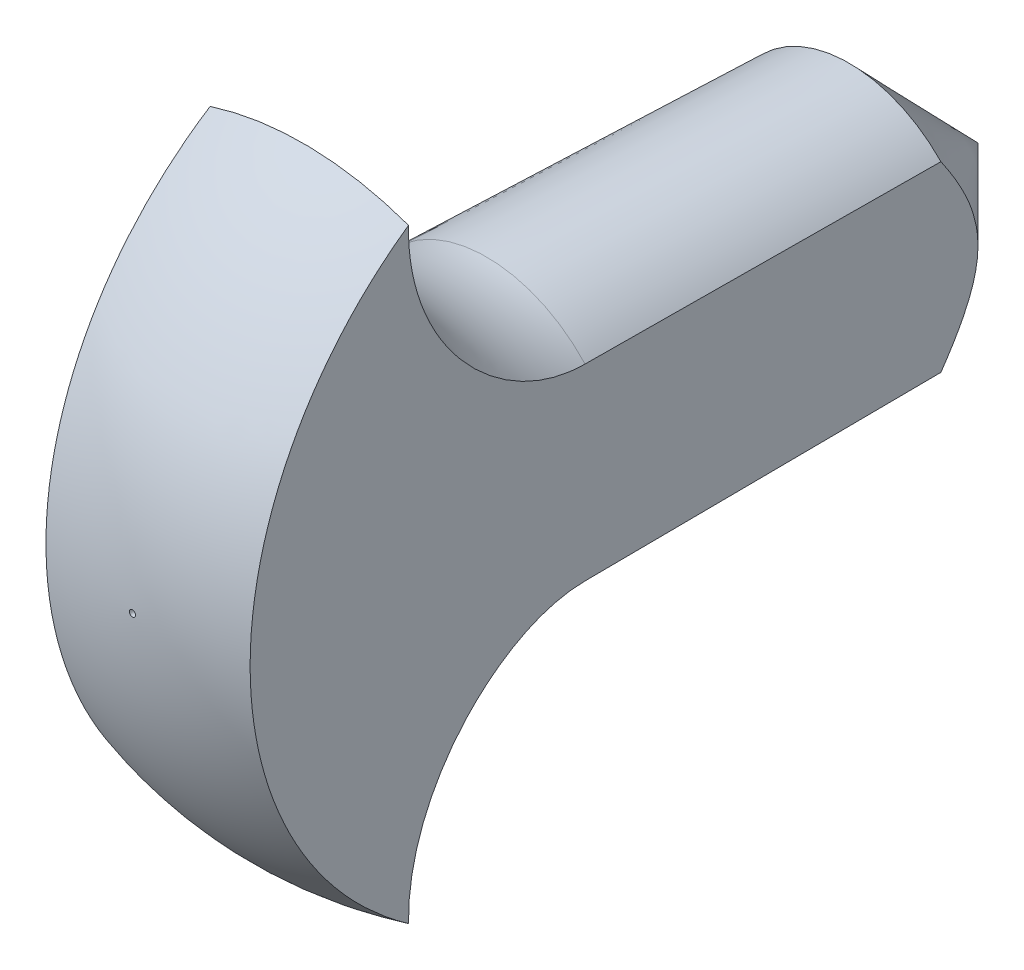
ISO-10303-21;
HEADER;
FILE_DESCRIPTION(('STEP AP214'),'2;1');
FILE_NAME('part.step','',(''),(''),'','','');
FILE_SCHEMA(('AUTOMOTIVE_DESIGN { 1 0 10303 214 1 1 1 1 }'));
ENDSEC;
DATA;
#1=APPLICATION_CONTEXT('core data for automotive mechanical design processes');
#2=APPLICATION_PROTOCOL_DEFINITION('international standard','automotive_design',2000,#1);
#3=PRODUCT_CONTEXT('',#1,'mechanical');
#4=PRODUCT('Part','Part','',(#3));
#5=PRODUCT_RELATED_PRODUCT_CATEGORY('part','',(#4));
#6=PRODUCT_DEFINITION_FORMATION('','',#4);
#7=PRODUCT_DEFINITION_CONTEXT('part definition',#1,'design');
#8=PRODUCT_DEFINITION('design','',#6,#7);
#9=PRODUCT_DEFINITION_SHAPE('','',#8);
#10=(LENGTH_UNIT() NAMED_UNIT(*) SI_UNIT(.MILLI.,.METRE.));
#11=(NAMED_UNIT(*) PLANE_ANGLE_UNIT() SI_UNIT($,.RADIAN.));
#12=(NAMED_UNIT(*) SI_UNIT($,.STERADIAN.) SOLID_ANGLE_UNIT());
#13=UNCERTAINTY_MEASURE_WITH_UNIT(LENGTH_MEASURE(1.E-05),#10,'distance_accuracy_value','');
#14=(GEOMETRIC_REPRESENTATION_CONTEXT(3) GLOBAL_UNCERTAINTY_ASSIGNED_CONTEXT((#13)) GLOBAL_UNIT_ASSIGNED_CONTEXT((#10,
#11,#12)) REPRESENTATION_CONTEXT('',''));
#15=CARTESIAN_POINT('',(0.,0.,0.));
#16=DIRECTION('',(0.,0.,1.));
#17=DIRECTION('',(1.,0.,0.));
#18=AXIS2_PLACEMENT_3D('',#15,#16,#17);
#19=CARTESIAN_POINT('',(0.445772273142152,0.,4.30718277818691));
#20=DIRECTION('',(0.018565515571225,0.,-0.99982764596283));
#21=DIRECTION('',(-0.99982764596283,0.,-0.018565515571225));
#22=AXIS2_PLACEMENT_3D('',#19,#20,#21);
#23=TOROIDAL_SURFACE('',#22,40.772031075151,23.2496751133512);
#24=CARTESIAN_POINT('',(0.43775861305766,0.,4.73875058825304));
#25=DIRECTION('',(0.018565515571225,0.,-0.99982764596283));
#26=DIRECTION('',(-0.99982764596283,0.,-0.018565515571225));
#27=AXIS2_PLACEMENT_3D('',#24,#25,#26);
#28=CIRCLE('',#27,17.5263631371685);
#29=CARTESIAN_POINT('',(13.0771759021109,-12.1393349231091,4.97344833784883));
#30=VERTEX_POINT('',#29);
#31=CARTESIAN_POINT('',(-12.2016586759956,-12.1393349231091,4.50405283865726));
#32=VERTEX_POINT('',#31);
#33=EDGE_CURVE('E64',#30,#32,#28,.T.);
#34=ORIENTED_EDGE('',*,*,#33,.F.);
#35=CARTESIAN_POINT('',(13.0771759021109,-29.4554696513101,26.1614828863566));
#36=CARTESIAN_POINT('',(13.0771759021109,-30.1196909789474,26.4028095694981));
#37=CARTESIAN_POINT('',(13.0771759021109,-30.7931204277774,26.6188789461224));
#38=CARTESIAN_POINT('',(13.0771759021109,-32.1546858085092,26.9983429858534));
#39=CARTESIAN_POINT('',(13.0771759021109,-32.8428219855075,27.1617367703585));
#40=CARTESIAN_POINT('',(13.0771759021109,-34.2301860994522,27.4340023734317));
#41=CARTESIAN_POINT('',(13.0771759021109,-34.9294194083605,27.5428469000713));
#42=CARTESIAN_POINT('',(13.0771759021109,-36.3343907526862,27.7042731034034));
#43=CARTESIAN_POINT('',(13.0771759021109,-37.0401290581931,27.7568524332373));
#44=CARTESIAN_POINT('',(13.0771759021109,-38.5060132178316,27.8062359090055));
#45=CARTESIAN_POINT('',(13.0771759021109,-39.266313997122,27.7986163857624));
#46=CARTESIAN_POINT('',(13.0771759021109,-40.7833072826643,27.7159350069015));
#47=CARTESIAN_POINT('',(13.0771759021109,-41.5399995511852,27.6408687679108));
#48=CARTESIAN_POINT('',(13.0771759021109,-43.0435185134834,27.4228662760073));
#49=CARTESIAN_POINT('',(13.0771759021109,-43.7903459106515,27.2799348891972));
#50=CARTESIAN_POINT('',(13.0771759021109,-45.2678037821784,26.9264318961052));
#51=CARTESIAN_POINT('',(13.0771759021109,-45.9984354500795,26.7158652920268));
#52=CARTESIAN_POINT('',(13.0771759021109,-47.3922997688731,26.2432147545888));
#53=CARTESIAN_POINT('',(13.0771759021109,-48.0568976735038,25.9851507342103));
#54=CARTESIAN_POINT('',(13.0771759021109,-49.3608934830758,25.4116996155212));
#55=CARTESIAN_POINT('',(13.0771759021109,-50.0002922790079,25.0963145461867));
#56=CARTESIAN_POINT('',(13.0771759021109,-51.248473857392,24.4102060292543));
#57=CARTESIAN_POINT('',(13.0771759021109,-51.8572645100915,24.0394969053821));
#58=CARTESIAN_POINT('',(13.0771759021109,-53.0392734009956,23.2451374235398));
#59=CARTESIAN_POINT('',(13.0771759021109,-53.6124927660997,22.8214887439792));
#60=CARTESIAN_POINT('',(13.0771759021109,-54.6922960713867,21.9454669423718));
#61=CARTESIAN_POINT('',(13.0771759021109,-55.2007484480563,21.4953950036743));
#62=CARTESIAN_POINT('',(13.0771759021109,-56.1768410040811,20.5529824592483));
#63=CARTESIAN_POINT('',(13.0771759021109,-56.6444825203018,20.0606432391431));
#64=CARTESIAN_POINT('',(13.0771759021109,-57.5351161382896,19.0372238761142));
#65=CARTESIAN_POINT('',(13.0771759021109,-57.9581143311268,18.5061490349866));
#66=CARTESIAN_POINT('',(13.0771759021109,-58.7560622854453,17.4090468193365));
#67=CARTESIAN_POINT('',(13.0771759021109,-59.1310128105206,16.8430200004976));
#68=CARTESIAN_POINT('',(13.0771759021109,-59.8192572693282,15.69768366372));
#69=CARTESIAN_POINT('',(13.0771759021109,-60.1340639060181,15.1192826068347));
#70=CARTESIAN_POINT('',(13.0771759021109,-60.7130492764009,13.9376756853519));
#71=CARTESIAN_POINT('',(13.0771759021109,-60.9772291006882,13.3344703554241));
#72=CARTESIAN_POINT('',(13.0771759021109,-61.4528309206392,12.1076631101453));
#73=CARTESIAN_POINT('',(13.0771759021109,-61.6642573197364,11.4840629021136));
#74=CARTESIAN_POINT('',(13.0771759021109,-62.0326710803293,10.2209811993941));
#75=CARTESIAN_POINT('',(13.0771759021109,-62.1896588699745,9.58149982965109));
#76=CARTESIAN_POINT('',(13.0771759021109,-62.4456535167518,8.30266606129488));
#77=CARTESIAN_POINT('',(13.0771759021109,-62.5456257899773,7.66350675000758));
#78=CARTESIAN_POINT('',(13.0771759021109,-62.6909756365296,6.37901353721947));
#79=CARTESIAN_POINT('',(13.0771759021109,-62.736353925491,5.73367971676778));
#80=CARTESIAN_POINT('',(13.0771759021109,-62.7721321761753,4.44152024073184));
#81=CARTESIAN_POINT('',(13.0771759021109,-62.7625347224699,3.79469465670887));
#82=CARTESIAN_POINT('',(13.0771759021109,-62.6884098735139,2.50419805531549));
#83=CARTESIAN_POINT('',(13.0771759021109,-62.6238825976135,1.86052703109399));
#84=CARTESIAN_POINT('',(13.0771759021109,-62.4410806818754,0.585961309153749));
#85=CARTESIAN_POINT('',(13.0771759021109,-62.3232266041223,-0.0449937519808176));
#86=CARTESIAN_POINT('',(13.0771759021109,-62.0347720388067,-1.29472484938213));
#87=CARTESIAN_POINT('',(13.0771759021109,-61.8641719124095,-1.91350096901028));
#88=CARTESIAN_POINT('',(13.0771759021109,-61.4715003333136,-3.13448583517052));
#89=CARTESIAN_POINT('',(13.0771759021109,-61.2494297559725,-3.73669486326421));
#90=CARTESIAN_POINT('',(13.0771759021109,-60.7554754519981,-4.92032337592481));
#91=CARTESIAN_POINT('',(13.0771759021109,-60.4835915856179,-5.50174280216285));
#92=CARTESIAN_POINT('',(13.0771759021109,-59.8917565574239,-6.64028911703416));
#93=CARTESIAN_POINT('',(13.0771759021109,-59.5717592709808,-7.19739202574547));
#94=CARTESIAN_POINT('',(13.0771759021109,-58.8862789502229,-8.28286620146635));
#95=CARTESIAN_POINT('',(13.0771759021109,-58.520795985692,-8.81123751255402));
#96=CARTESIAN_POINT('',(13.0771759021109,-57.7470517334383,-9.83567088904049));
#97=CARTESIAN_POINT('',(13.0771759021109,-57.3387900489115,-10.3317326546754));
#98=CARTESIAN_POINT('',(13.0771759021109,-56.4824962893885,-11.2882482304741));
#99=CARTESIAN_POINT('',(13.0771759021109,-56.034463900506,-11.7487017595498));
#100=CARTESIAN_POINT('',(13.0771759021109,-55.0971549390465,-12.6355049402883));
#101=CARTESIAN_POINT('',(13.0771759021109,-54.6075055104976,-13.0614604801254));
#102=CARTESIAN_POINT('',(13.0771759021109,-53.5945613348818,-13.8712726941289));
#103=CARTESIAN_POINT('',(13.0771759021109,-53.0712664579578,-14.2551292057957));
#104=CARTESIAN_POINT('',(13.0771759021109,-51.9948063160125,-14.9784134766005));
#105=CARTESIAN_POINT('',(13.0771759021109,-51.4416399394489,-15.3178395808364));
#106=CARTESIAN_POINT('',(13.0771759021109,-50.3093982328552,-15.9502960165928));
#107=CARTESIAN_POINT('',(13.0771759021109,-49.7303225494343,-16.2433257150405));
#108=CARTESIAN_POINT('',(13.0771759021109,-48.5377231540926,-16.7871761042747));
#109=CARTESIAN_POINT('',(13.0771759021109,-47.9237281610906,-17.0369633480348));
#110=CARTESIAN_POINT('',(13.0771759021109,-46.6773217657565,-17.4853027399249));
#111=CARTESIAN_POINT('',(13.0771759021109,-46.0449101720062,-17.6838543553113));
#112=CARTESIAN_POINT('',(13.0771759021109,-44.7660195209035,-18.0289613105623));
#113=CARTESIAN_POINT('',(13.0771759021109,-44.1195394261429,-18.1755128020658));
#114=CARTESIAN_POINT('',(13.0771759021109,-42.8169134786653,-18.4162616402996));
#115=CARTESIAN_POINT('',(13.0771759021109,-42.1607674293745,-18.5104579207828));
#116=CARTESIAN_POINT('',(13.0771759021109,-40.8192695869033,-18.6490307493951));
#117=CARTESIAN_POINT('',(13.0771759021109,-40.1337190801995,-18.6914844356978));
#118=CARTESIAN_POINT('',(13.0771759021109,-38.761447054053,-18.720801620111));
#119=CARTESIAN_POINT('',(13.0771759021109,-38.0747255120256,-18.7076640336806));
#120=CARTESIAN_POINT('',(13.0771759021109,-36.7044410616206,-18.6267564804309));
#121=CARTESIAN_POINT('',(13.0771759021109,-36.0208785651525,-18.5589795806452));
#122=CARTESIAN_POINT('',(13.0771759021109,-34.6611700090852,-18.3701333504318));
#123=CARTESIAN_POINT('',(13.0771759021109,-33.9850241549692,-18.2490625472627));
#124=CARTESIAN_POINT('',(13.0771759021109,-32.606576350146,-17.947093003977));
#125=CARTESIAN_POINT('',(13.0771759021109,-31.9049234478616,-17.7632297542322));
#126=CARTESIAN_POINT('',(13.0771759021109,-30.5184851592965,-17.3402680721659));
#127=CARTESIAN_POINT('',(13.0771759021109,-29.8337003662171,-17.1011677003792));
#128=CARTESIAN_POINT('',(13.0771759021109,-28.484864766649,-16.5703078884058));
#129=CARTESIAN_POINT('',(13.0771759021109,-27.8208144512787,-16.2785472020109));
#130=CARTESIAN_POINT('',(13.0771759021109,-26.5166934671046,-15.6449861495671));
#131=CARTESIAN_POINT('',(13.0771759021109,-25.8766338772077,-15.3031630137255));
#132=CARTESIAN_POINT('',(13.0771759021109,-24.5761543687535,-14.5444901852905));
#133=CARTESIAN_POINT('',(13.0771759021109,-23.9179143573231,-14.1239038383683));
#134=CARTESIAN_POINT('',(13.0771759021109,-22.6369361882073,-13.2315940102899));
#135=CARTESIAN_POINT('',(13.0771759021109,-22.0142000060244,-12.7598676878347));
#136=CARTESIAN_POINT('',(13.0771759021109,-21.1093672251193,-12.0163668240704));
#137=CARTESIAN_POINT('',(13.0771759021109,-20.8124785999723,-11.7623973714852));
#138=CARTESIAN_POINT('',(13.0771759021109,-20.2290693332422,-11.2429583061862));
#139=CARTESIAN_POINT('',(13.0771759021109,-19.9425462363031,-10.9774914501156));
#140=CARTESIAN_POINT('',(13.0771759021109,-19.0991618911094,-10.1643192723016));
#141=CARTESIAN_POINT('',(13.0771759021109,-18.5583634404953,-9.59974199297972));
#142=CARTESIAN_POINT('',(13.0771759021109,-17.5871443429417,-8.49958168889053));
#143=CARTESIAN_POINT('',(13.0771759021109,-17.1512895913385,-7.96877610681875));
#144=CARTESIAN_POINT('',(13.0771759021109,-16.3201692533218,-6.8761451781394));
#145=CARTESIAN_POINT('',(13.0771759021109,-15.9249061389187,-6.31431794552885));
#146=CARTESIAN_POINT('',(13.0771759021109,-15.1804364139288,-5.16166817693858));
#147=CARTESIAN_POINT('',(13.0771759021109,-14.8311742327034,-4.57088183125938));
#148=CARTESIAN_POINT('',(13.0771759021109,-14.3465703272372,-3.66399776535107));
#149=CARTESIAN_POINT('',(13.0771759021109,-14.1915992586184,-3.35828814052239));
#150=CARTESIAN_POINT('',(13.0771759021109,-13.8956690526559,-2.7400506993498));
#151=CARTESIAN_POINT('',(13.0771759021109,-13.7547133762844,-2.42752122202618));
#152=CARTESIAN_POINT('',(13.0771759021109,-13.4280472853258,-1.6541974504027));
#153=CARTESIAN_POINT('',(13.0771759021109,-13.2506619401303,-1.18984359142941));
#154=CARTESIAN_POINT('',(13.0771759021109,-12.9314752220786,-0.249159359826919));
#155=CARTESIAN_POINT('',(13.0771759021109,-12.7896633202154,0.227167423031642));
#156=CARTESIAN_POINT('',(13.0771759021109,-12.5456214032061,1.18894403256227));
#157=CARTESIAN_POINT('',(13.0771759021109,-12.443313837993,1.67437400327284));
#158=CARTESIAN_POINT('',(13.0771759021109,-12.2813380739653,2.65235529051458));
#159=CARTESIAN_POINT('',(13.0771759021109,-12.2216689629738,3.14490645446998));
#160=CARTESIAN_POINT('',(13.0771759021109,-12.1471710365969,4.1365771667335));
#161=CARTESIAN_POINT('',(13.0771759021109,-12.132628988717,4.63571856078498));
#162=CARTESIAN_POINT('',(13.0771759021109,-12.150056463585,5.63317508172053));
#163=CARTESIAN_POINT('',(13.0771759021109,-12.1820249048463,6.13149022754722));
#164=CARTESIAN_POINT('',(13.0771759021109,-12.2915408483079,7.12364259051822));
#165=CARTESIAN_POINT('',(13.0771759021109,-12.369142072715,7.61747383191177));
#166=CARTESIAN_POINT('',(13.0771759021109,-12.5673807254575,8.5964079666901));
#167=CARTESIAN_POINT('',(13.0771759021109,-12.6880245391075,9.08150955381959));
#168=CARTESIAN_POINT('',(13.0771759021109,-12.9933919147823,10.1240686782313));
#169=CARTESIAN_POINT('',(13.0771759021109,-13.1856380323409,10.6793174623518));
#170=CARTESIAN_POINT('',(13.0771759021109,-13.6184271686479,11.7707793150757));
#171=CARTESIAN_POINT('',(13.0771759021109,-13.8589884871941,12.3069850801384));
#172=CARTESIAN_POINT('',(13.0771759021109,-14.251798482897,13.0958568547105));
#173=CARTESIAN_POINT('',(13.0771759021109,-14.3882415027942,13.3565370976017));
#174=CARTESIAN_POINT('',(13.0771759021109,-14.6710569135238,13.8723291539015));
#175=CARTESIAN_POINT('',(13.0771759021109,-14.8174254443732,14.1274430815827));
#176=CARTESIAN_POINT('',(13.0771759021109,-15.2706260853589,14.8844426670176));
#177=CARTESIAN_POINT('',(13.0771759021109,-15.5915357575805,15.3779512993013));
#178=CARTESIAN_POINT('',(13.0771759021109,-16.3752235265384,16.4965124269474));
#179=CARTESIAN_POINT('',(13.0771759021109,-16.8504428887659,17.1128475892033));
#180=CARTESIAN_POINT('',(13.0771759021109,-17.851784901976,18.3028004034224));
#181=CARTESIAN_POINT('',(13.0771759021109,-18.3779228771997,18.8764051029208));
#182=CARTESIAN_POINT('',(13.0771759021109,-19.4751372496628,19.978249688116));
#183=CARTESIAN_POINT('',(13.0771759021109,-20.0461909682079,20.5065121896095));
#184=CARTESIAN_POINT('',(13.0771759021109,-21.2287959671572,21.5153347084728));
#185=CARTESIAN_POINT('',(13.0771759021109,-21.8403390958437,21.9959042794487));
#186=CARTESIAN_POINT('',(13.0771759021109,-23.0061256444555,22.8387473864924));
#187=CARTESIAN_POINT('',(13.0771759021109,-23.5553535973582,23.2079826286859));
#188=CARTESIAN_POINT('',(13.0771759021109,-24.6777973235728,23.9079676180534));
#189=CARTESIAN_POINT('',(13.0771759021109,-25.2510116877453,24.2387196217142));
#190=CARTESIAN_POINT('',(13.0771759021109,-26.4187544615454,24.859689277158));
#191=CARTESIAN_POINT('',(13.0771759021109,-27.0132756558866,25.1499204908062));
#192=CARTESIAN_POINT('',(13.0771759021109,-28.2210064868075,25.6879519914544));
#193=CARTESIAN_POINT('',(13.0771759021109,-28.8342103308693,25.9357652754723));
#194=CARTESIAN_POINT('',(13.0771759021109,-29.4554696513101,26.1614828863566));
#195=B_SPLINE_CURVE_WITH_KNOTS('',3,(#35,#36,#37,#38,#39,#40,#41,#42,#43,#44,#45,#46,#47,#48,
#49,#50,#51,#52,#53,#54,#55,#56,#57,#58,#59,#60,#61,#62,#63,#64,#65,#66,#67,#68,#69,#70,#71,#72,
#73,#74,#75,#76,#77,#78,#79,#80,#81,#82,#83,#84,#85,#86,#87,#88,#89,#90,#91,#92,#93,#94,#95,#96,
#97,#98,#99,#100,#101,#102,#103,#104,#105,#106,#107,#108,#109,#110,#111,#112,#113,#114,#115,
#116,#117,#118,#119,#120,#121,#122,#123,#124,#125,#126,#127,#128,#129,#130,#131,#132,#133,#134,
#135,#136,#137,#138,#139,#140,#141,#142,#143,#144,#145,#146,#147,#148,#149,#150,#151,#152,#153,
#154,#155,#156,#157,#158,#159,#160,#161,#162,#163,#164,#165,#166,#167,#168,#169,#170,#171,#172,
#173,#174,#175,#176,#177,#178,#179,#180,#181,#182,#183,#184,#185,#186,#187,#188,#189,#190,#191,
#192,#193,#194),.UNSPECIFIED.,.T.,.F.,(4,2,2,2,2,2,2,2,2,2,2,2,2,2,2,2,2,2,2,2,2,2,2,2,2,2,2,2,
2,2,2,2,2,2,2,2,2,2,2,2,2,2,2,2,2,2,2,2,2,2,2,2,2,2,2,2,2,2,2,2,2,2,2,2,2,2,2,2,2,2,2,2,2,2,2,2,
2,2,2,4),(0.,2.11962813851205,4.23929162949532,6.3600145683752,8.48082596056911,
10.7588570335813,13.0370361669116,15.315051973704,17.5928993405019,19.7290386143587,
21.8651022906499,24.000613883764,26.1360577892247,28.1706600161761,30.2051955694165,
32.2394531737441,34.2736784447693,36.2468530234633,38.2199850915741,40.1929524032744,
42.165904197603,44.1043734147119,46.0428172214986,47.9811698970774,49.9195183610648,
51.8428395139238,53.7661474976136,55.6894227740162,57.6127034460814,59.5378397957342,
61.4629731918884,63.3881244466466,65.3132908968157,67.258020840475,69.2027582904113,
71.147568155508,73.0924045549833,75.0787175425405,77.0650511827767,79.0515317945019,
81.0380528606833,83.0963438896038,85.1546750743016,87.2132674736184,89.2719167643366,
91.4455756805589,93.6193109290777,95.7930976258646,97.9678761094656,100.308791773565,
102.649837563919,103.821658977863,104.993200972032,107.335812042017,109.394537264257,
111.453387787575,113.509727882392,114.537664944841,115.565855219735,117.055742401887,
118.545188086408,120.031694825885,121.518169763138,123.014071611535,124.509938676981,
126.007570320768,127.505424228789,129.265630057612,131.026503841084,131.909007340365,
132.791169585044,134.555610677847,136.887305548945,139.219704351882,141.550932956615,
143.881693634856,145.865614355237,147.849418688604,149.832557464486,151.815087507),.UNSPECIFIED.);
#196=CARTESIAN_POINT('',(13.0771759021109,-39.0773928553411,27.791406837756));
#197=VERTEX_POINT('',#196);
#198=EDGE_CURVE('E184',#30,#197,#195,.T.);
#199=ORIENTED_EDGE('',*,*,#198,.T.);
#200=CARTESIAN_POINT('',(0.0142044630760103,0.,27.5488442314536));
#201=DIRECTION('',(0.018565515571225,0.,-0.99982764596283));
#202=DIRECTION('',(-0.99982764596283,0.,-0.018565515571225));
#203=AXIS2_PLACEMENT_3D('',#200,#201,#202);
#204=CIRCLE('',#203,41.2036732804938);
#205=CARTESIAN_POINT('',(-13.0487669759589,-39.0773928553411,27.3062816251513));
#206=VERTEX_POINT('',#205);
#207=EDGE_CURVE('E224',#197,#206,#204,.T.);
#208=ORIENTED_EDGE('',*,*,#207,.T.);
#209=CARTESIAN_POINT('',(-13.0440976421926,-41.2038732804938,27.1805937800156));
#210=CARTESIAN_POINT('',(-13.0454920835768,-40.8323332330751,27.2181289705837));
#211=CARTESIAN_POINT('',(-13.0465825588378,-40.4600144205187,27.2474820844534));
#212=CARTESIAN_POINT('',(-13.048158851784,-39.714471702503,27.2899123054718));
#213=CARTESIAN_POINT('',(-13.0486447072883,-39.3412478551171,27.3029904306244));
#214=CARTESIAN_POINT('',(-13.0492002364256,-38.221577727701,27.3179440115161));
#215=CARTESIAN_POINT('',(-13.0483695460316,-37.4746832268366,27.2955837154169));
#216=CARTESIAN_POINT('',(-13.0443568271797,-35.9881355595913,27.187570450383));
#217=CARTESIAN_POINT('',(-13.0411829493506,-35.2484662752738,27.1021368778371));
#218=CARTESIAN_POINT('',(-13.0347150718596,-34.146425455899,26.9280363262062));
#219=CARTESIAN_POINT('',(-13.0322743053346,-33.7802896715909,26.8623364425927));
#220=CARTESIAN_POINT('',(-13.026832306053,-33.0509675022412,26.7158501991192));
#221=CARTESIAN_POINT('',(-13.0238309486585,-32.6877817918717,26.6350604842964));
#222=CARTESIAN_POINT('',(-13.0140105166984,-31.6046891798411,26.3707167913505));
#223=CARTESIAN_POINT('',(-13.0063682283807,-30.8900858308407,26.1650037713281));
#224=CARTESIAN_POINT('',(-12.9889761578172,-29.4797381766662,25.6968487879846));
#225=CARTESIAN_POINT('',(-12.9792262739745,-28.7839947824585,25.4344040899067));
#226=CARTESIAN_POINT('',(-12.9630922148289,-27.7574066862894,25.0001119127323));
#227=CARTESIAN_POINT('',(-12.9574592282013,-27.4178708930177,24.8484847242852));
#228=CARTESIAN_POINT('',(-12.9457043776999,-26.7450996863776,24.5320708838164));
#229=CARTESIAN_POINT('',(-12.9395826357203,-26.411862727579,24.3672875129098));
#230=CARTESIAN_POINT('',(-12.92049980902,-25.4221056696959,23.8536212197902));
#231=CARTESIAN_POINT('',(-12.9068206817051,-24.7755113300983,23.485410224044));
#232=CARTESIAN_POINT('',(-12.876751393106,-23.4734751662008,22.6760133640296));
#233=CARTESIAN_POINT('',(-12.8602456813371,-22.8199737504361,22.2317171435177));
#234=CARTESIAN_POINT('',(-12.8253136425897,-21.5511961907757,21.2914261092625));
#235=CARTESIAN_POINT('',(-12.8068870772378,-20.9359248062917,20.795424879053));
#236=CARTESIAN_POINT('',(-12.7682054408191,-19.7474067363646,19.754203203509));
#237=CARTESIAN_POINT('',(-12.747948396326,-19.1742066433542,19.2089296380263));
#238=CARTESIAN_POINT('',(-12.7057235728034,-18.0755986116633,18.0723334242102));
#239=CARTESIAN_POINT('',(-12.6837561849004,-17.550179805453,17.4810213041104));
#240=CARTESIAN_POINT('',(-12.6431335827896,-16.6613566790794,16.3875532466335));
#241=CARTESIAN_POINT('',(-12.6247921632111,-16.2875166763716,15.8938439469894));
#242=CARTESIAN_POINT('',(-12.5871460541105,-15.5767309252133,14.8804963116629));
#243=CARTESIAN_POINT('',(-12.567841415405,-15.239783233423,14.3608593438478));
#244=CARTESIAN_POINT('',(-12.5284062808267,-14.6091503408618,13.2993552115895));
#245=CARTESIAN_POINT('',(-12.5082803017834,-14.315260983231,12.7576096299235));
#246=CARTESIAN_POINT('',(-12.4671683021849,-13.7746972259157,11.650968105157));
#247=CARTESIAN_POINT('',(-12.4461824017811,-13.5280162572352,11.0860753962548));
#248=CARTESIAN_POINT('',(-12.4068561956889,-13.1238815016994,10.0275033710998));
#249=CARTESIAN_POINT('',(-12.3886285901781,-12.9584695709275,9.53685768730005));
#250=CARTESIAN_POINT('',(-12.351716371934,-12.6702497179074,8.54326472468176));
#251=CARTESIAN_POINT('',(-12.3330319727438,-12.5474222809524,8.04032319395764));
#252=CARTESIAN_POINT('',(-12.3046514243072,-12.3974671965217,7.27638337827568));
#253=CARTESIAN_POINT('',(-12.2950776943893,-12.3530461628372,7.01868034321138));
#254=CARTESIAN_POINT('',(-12.2758623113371,-12.2764494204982,6.50144593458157));
#255=CARTESIAN_POINT('',(-12.2662206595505,-12.2442734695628,6.24191459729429));
#256=CARTESIAN_POINT('',(-12.246875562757,-12.1924388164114,5.72118858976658));
#257=CARTESIAN_POINT('',(-12.2371720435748,-12.17280021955,5.45999192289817));
#258=CARTESIAN_POINT('',(-12.2177399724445,-12.1462630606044,4.93692476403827));
#259=CARTESIAN_POINT('',(-12.2080114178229,-12.1393659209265,4.67505420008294));
#260=CARTESIAN_POINT('',(-12.1982821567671,-12.1389123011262,4.413164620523));
#261=B_SPLINE_CURVE_WITH_KNOTS('',3,(#209,#210,#211,#212,#213,#214,#215,#216,#217,#218,#219,
#220,#221,#222,#223,#224,#225,#226,#227,#228,#229,#230,#231,#232,#233,#234,#235,#236,#237,#238,
#239,#240,#241,#242,#243,#244,#245,#246,#247,#248,#249,#250,#251,#252,#253,#254,#255,#256,#257,
#258,#259,#260),.UNSPECIFIED.,.F.,.F.,(4,2,2,2,2,2,2,2,2,2,2,2,2,2,2,2,2,2,2,2,2,2,2,2,2,4),(0.,
1.120117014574,2.24016396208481,4.47890687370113,6.70989893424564,7.82559629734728,
8.94154201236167,11.1699176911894,13.3984008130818,14.5138399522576,15.6290017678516,
17.8592342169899,20.2278487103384,22.5967574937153,24.9682513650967,27.3392045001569,
29.1963802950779,31.0534582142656,32.9014243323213,34.7491331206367,36.301774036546,
37.8537024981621,38.6384954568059,39.4232728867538,40.2093056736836,40.9954262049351),.UNSPECIFIED.);
#262=EDGE_CURVE('E213',#206,#32,#261,.T.);
#263=ORIENTED_EDGE('',*,*,#262,.T.);
#264=EDGE_LOOP('',(#34,#199,#208,#263));
#265=FACE_BOUND('',#264,.T.);
#266=ADVANCED_FACE('F46',(#265),#23,.F.);
#267=CARTESIAN_POINT('',(0.525569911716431,0.,0.00975915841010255));
#268=DIRECTION('',(0.018565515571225,0.,-0.99982764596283));
#269=DIRECTION('',(-0.99982764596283,0.,-0.018565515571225));
#270=AXIS2_PLACEMENT_3D('',#267,#268,#269);
#271=DEGENERATE_TOROIDAL_SURFACE('',#270,0.525660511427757,50.,.F.);
#272=CARTESIAN_POINT('',(-0.402545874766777,0.,49.9925252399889));
#273=DIRECTION('',(0.018565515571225,0.,-0.99982764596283));
#274=DIRECTION('',(-0.99982764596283,0.,-0.018565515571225));
#275=AXIS2_PLACEMENT_3D('',#272,#273,#274);
#276=CIRCLE('',#275,0.402615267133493);
#277=CARTESIAN_POINT('',(-0.805091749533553,0.,49.9850504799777));
#278=VERTEX_POINT('',#277);
#279=EDGE_CURVE('E196',#278,#278,#276,.T.);
#280=ORIENTED_EDGE('',*,*,#279,.T.);
#281=EDGE_LOOP('',(#280));
#282=FACE_BOUND('',#281,.T.);
#283=ORIENTED_EDGE('',*,*,#207,.F.);
#284=CARTESIAN_POINT('',(13.0771759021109,-41.021577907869,24.792158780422));
#285=CARTESIAN_POINT('',(13.0771759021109,-40.7085503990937,25.3165698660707));
#286=CARTESIAN_POINT('',(13.0771759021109,-40.3856147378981,25.8349972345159));
#287=CARTESIAN_POINT('',(13.0771759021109,-39.7203351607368,26.8592435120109));
#288=CARTESIAN_POINT('',(13.0771759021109,-39.3779913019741,27.3650624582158));
#289=CARTESIAN_POINT('',(13.0771759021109,-38.322656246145,28.862366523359));
#290=CARTESIAN_POINT('',(13.0771759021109,-37.5811835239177,29.8339970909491));
#291=CARTESIAN_POINT('',(13.0771759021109,-36.0267803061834,31.7182676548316));
#292=CARTESIAN_POINT('',(13.0771759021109,-35.2138447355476,32.6309034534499));
#293=CARTESIAN_POINT('',(13.0771759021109,-33.5210902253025,34.3920225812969));
#294=CARTESIAN_POINT('',(13.0771759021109,-32.6412662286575,35.2405010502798));
#295=CARTESIAN_POINT('',(13.0771759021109,-30.7177161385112,36.9595313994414));
#296=CARTESIAN_POINT('',(13.0771759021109,-29.6666697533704,37.8219110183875));
#297=CARTESIAN_POINT('',(13.0771759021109,-27.4955112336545,39.4549690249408));
#298=CARTESIAN_POINT('',(13.0771759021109,-26.3753937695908,40.2256403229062));
#299=CARTESIAN_POINT('',(13.0771759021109,-24.073876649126,41.6697436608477));
#300=CARTESIAN_POINT('',(13.0771759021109,-22.8924673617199,42.3431603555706));
#301=CARTESIAN_POINT('',(13.0771759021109,-20.476921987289,43.5875923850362));
#302=CARTESIAN_POINT('',(13.0771759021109,-19.2427870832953,44.1586100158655));
#303=CARTESIAN_POINT('',(13.0771759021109,-16.7336971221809,45.192549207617));
#304=CARTESIAN_POINT('',(13.0771759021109,-15.4588537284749,45.6557416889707));
#305=CARTESIAN_POINT('',(13.0771759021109,-12.8743580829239,46.4720626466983));
#306=CARTESIAN_POINT('',(13.0771759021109,-11.5647052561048,46.825189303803));
#307=CARTESIAN_POINT('',(13.0771759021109,-8.92030137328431,47.4178943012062));
#308=CARTESIAN_POINT('',(13.0771759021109,-7.58555728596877,47.6575036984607));
#309=CARTESIAN_POINT('',(13.0771759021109,-4.90036543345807,48.0203450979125));
#310=CARTESIAN_POINT('',(13.0771759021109,-3.54991844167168,48.1435828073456));
#311=CARTESIAN_POINT('',(13.0771759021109,-0.866835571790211,48.2705504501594));
#312=CARTESIAN_POINT('',(13.0771759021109,0.4657043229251,48.2763107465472));
#313=CARTESIAN_POINT('',(13.0771759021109,3.12635804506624,48.1733897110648));
#314=CARTESIAN_POINT('',(13.0771759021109,4.45447184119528,48.0647075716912));
#315=CARTESIAN_POINT('',(13.0771759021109,7.09666992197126,47.7346809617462));
#316=CARTESIAN_POINT('',(13.0771759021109,8.41075332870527,47.513329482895));
#317=CARTESIAN_POINT('',(13.0771759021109,11.0155945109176,46.9606923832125));
#318=CARTESIAN_POINT('',(13.0771759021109,12.3063520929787,46.629405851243));
#319=CARTESIAN_POINT('',(13.0771759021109,14.8427362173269,45.8639718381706));
#320=CARTESIAN_POINT('',(13.0771759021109,16.0886863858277,45.4308940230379));
#321=CARTESIAN_POINT('',(13.0771759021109,18.5408010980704,44.4634938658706));
#322=CARTESIAN_POINT('',(13.0771759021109,19.746966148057,43.9291728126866));
#323=CARTESIAN_POINT('',(13.0771759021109,21.5202083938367,43.0547949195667));
#324=CARTESIAN_POINT('',(13.0771759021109,22.1054738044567,42.7510749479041));
#325=CARTESIAN_POINT('',(13.0771759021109,23.263033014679,42.1198550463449));
#326=CARTESIAN_POINT('',(13.0771759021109,23.8353276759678,41.7923567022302));
#327=CARTESIAN_POINT('',(13.0771759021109,24.9659296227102,41.114182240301));
#328=CARTESIAN_POINT('',(13.0771759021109,25.5242384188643,40.7635086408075));
#329=CARTESIAN_POINT('',(13.0771759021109,26.6261170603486,40.0394939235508));
#330=CARTESIAN_POINT('',(13.0771759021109,27.169683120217,39.6661470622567));
#331=CARTESIAN_POINT('',(13.0771759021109,28.8034259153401,38.4939748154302));
#332=CARTESIAN_POINT('',(13.0771759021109,29.8685619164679,37.6598313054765));
#333=CARTESIAN_POINT('',(13.0771759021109,31.9250654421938,35.905095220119));
#334=CARTESIAN_POINT('',(13.0771759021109,32.916432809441,34.984502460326));
#335=CARTESIAN_POINT('',(13.0771759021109,34.3421014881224,33.5446366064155));
#336=CARTESIAN_POINT('',(13.0771759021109,34.8068331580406,33.0551636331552));
#337=CARTESIAN_POINT('',(13.0771759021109,35.7153100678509,32.0572623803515));
#338=CARTESIAN_POINT('',(13.0771759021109,36.1590600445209,31.5488384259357));
#339=CARTESIAN_POINT('',(13.0771759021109,37.0246856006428,30.5140822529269));
#340=CARTESIAN_POINT('',(13.0771759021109,37.446570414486,29.9877577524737));
#341=CARTESIAN_POINT('',(13.0771759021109,38.2679315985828,28.9179265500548));
#342=CARTESIAN_POINT('',(13.0771759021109,38.667408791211,28.3744204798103));
#343=CARTESIAN_POINT('',(13.0771759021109,39.4020067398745,27.3298403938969));
#344=CARTESIAN_POINT('',(13.0771759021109,39.7394538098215,26.8304001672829));
#345=CARTESIAN_POINT('',(13.0771759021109,40.3949946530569,25.8199390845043));
#346=CARTESIAN_POINT('',(13.0771759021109,40.7131140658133,25.3089348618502));
#347=CARTESIAN_POINT('',(13.0771759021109,41.021577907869,24.792158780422));
#348=B_SPLINE_CURVE_WITH_KNOTS('',3,(#284,#285,#286,#287,#288,#289,#290,#291,#292,#293,#294,
#295,#296,#297,#298,#299,#300,#301,#302,#303,#304,#305,#306,#307,#308,#309,#310,#311,#312,#313,
#314,#315,#316,#317,#318,#319,#320,#321,#322,#323,#324,#325,#326,#327,#328,#329,#330,#331,#332,
#333,#334,#335,#336,#337,#338,#339,#340,#341,#342,#343,#344,#345,#346,#347),.UNSPECIFIED.,.F.,
.F.,(4,2,2,2,2,2,2,2,2,2,2,2,2,2,2,2,2,2,2,2,2,2,2,2,2,2,2,2,2,2,2,4),(0.,1.83196630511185,
3.6639272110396,7.32680974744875,10.9899526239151,14.6533727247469,18.7271213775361,
22.8011847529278,26.8758902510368,30.9505043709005,35.014767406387,39.0790976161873,
43.1423152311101,47.2053335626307,51.1980700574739,55.1908347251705,59.1838477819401,
63.1768939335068,67.1297205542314,71.0824968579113,73.0601792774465,75.0377299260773,
77.0150660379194,78.9929051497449,83.0464786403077,87.1000607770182,89.1244207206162,
91.1483214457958,93.1713603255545,95.1943249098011,97.0021690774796,98.8075601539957),.UNSPECIFIED.);
#349=CARTESIAN_POINT('',(13.0771759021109,39.0773928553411,27.7914068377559));
#350=VERTEX_POINT('',#349);
#351=EDGE_CURVE('E73',#197,#350,#348,.T.);
#352=ORIENTED_EDGE('',*,*,#351,.T.);
#353=CARTESIAN_POINT('',(-13.0487669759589,39.0773928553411,27.3062816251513));
#354=VERTEX_POINT('',#353);
#355=EDGE_CURVE('E232',#354,#350,#204,.T.);
#356=ORIENTED_EDGE('',*,*,#355,.F.);
#357=CARTESIAN_POINT('',(-12.9553667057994,40.7291917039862,24.792158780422));
#358=CARTESIAN_POINT('',(-12.9744417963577,40.4142887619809,25.3056168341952));
#359=CARTESIAN_POINT('',(-12.9932964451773,40.0898067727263,25.81314109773));
#360=CARTESIAN_POINT('',(-13.0305421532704,39.4220837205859,26.8157108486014));
#361=CARTESIAN_POINT('',(-13.0489332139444,39.0788427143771,27.3107563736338));
#362=CARTESIAN_POINT('',(-13.1033667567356,38.0217781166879,28.7759835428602));
#363=CARTESIAN_POINT('',(-13.1386805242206,37.2804325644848,29.7265498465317));
#364=CARTESIAN_POINT('',(-13.2071545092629,35.7286409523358,31.5697137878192));
#365=CARTESIAN_POINT('',(-13.2403143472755,34.9181827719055,32.4623012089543));
#366=CARTESIAN_POINT('',(-13.3042939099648,33.2326693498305,34.1844855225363));
#367=CARTESIAN_POINT('',(-13.3351134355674,32.3576086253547,35.0140770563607));
#368=CARTESIAN_POINT('',(-13.3979850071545,30.4330040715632,36.7064367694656));
#369=CARTESIAN_POINT('',(-13.4296980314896,29.3754036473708,37.5600792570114));
#370=CARTESIAN_POINT('',(-13.4897002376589,27.1918400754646,39.1752021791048));
#371=CARTESIAN_POINT('',(-13.5179891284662,26.0658711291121,39.9366747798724));
#372=CARTESIAN_POINT('',(-13.5709397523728,23.7533819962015,41.3619851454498));
#373=CARTESIAN_POINT('',(-13.595600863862,22.5668514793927,42.0258061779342));
#374=CARTESIAN_POINT('',(-13.6411058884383,20.1418486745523,43.2506979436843));
#375=CARTESIAN_POINT('',(-13.6619498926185,18.9033776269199,43.8117711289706));
#376=CARTESIAN_POINT('',(-13.6996103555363,16.3865630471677,44.8255051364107));
#377=CARTESIAN_POINT('',(-13.7164372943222,15.1083333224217,45.2784480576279));
#378=CARTESIAN_POINT('',(-13.7459940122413,12.5179099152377,46.0740476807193));
#379=CARTESIAN_POINT('',(-13.7587237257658,11.2057156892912,46.4167026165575));
#380=CARTESIAN_POINT('',(-13.7799580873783,8.55710918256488,46.9882833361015));
#381=CARTESIAN_POINT('',(-13.7884639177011,7.22070378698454,47.2172409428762));
#382=CARTESIAN_POINT('',(-13.8011474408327,4.5330964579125,47.558652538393));
#383=CARTESIAN_POINT('',(-13.8053253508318,3.18189527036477,47.6711123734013));
#384=CARTESIAN_POINT('',(-13.8092475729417,0.49906614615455,47.7766896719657));
#385=CARTESIAN_POINT('',(-13.8090699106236,-0.832479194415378,47.7719074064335));
#386=CARTESIAN_POINT('',(-13.8044759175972,-3.49025534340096,47.6482475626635));
#387=CARTESIAN_POINT('',(-13.8000595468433,-4.81648610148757,47.5293689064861));
#388=CARTESIAN_POINT('',(-13.7870587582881,-7.45408208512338,47.1794172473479));
#389=CARTESIAN_POINT('',(-13.7784740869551,-8.76544640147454,46.9483374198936));
#390=CARTESIAN_POINT('',(-13.757239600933,-11.3640692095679,46.376753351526));
#391=CARTESIAN_POINT('',(-13.7445897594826,-12.6513275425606,46.0362483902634));
#392=CARTESIAN_POINT('',(-13.7154730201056,-15.1816671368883,45.2524919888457));
#393=CARTESIAN_POINT('',(-13.6990406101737,-16.4250370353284,44.8101688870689));
#394=CARTESIAN_POINT('',(-13.6624253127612,-18.8712058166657,43.8245683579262));
#395=CARTESIAN_POINT('',(-13.6422424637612,-20.0740051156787,43.2812919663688));
#396=CARTESIAN_POINT('',(-13.6092689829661,-21.8416523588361,42.3937208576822));
#397=CARTESIAN_POINT('',(-13.5978234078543,-22.4249769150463,42.0856320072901));
#398=CARTESIAN_POINT('',(-13.5740521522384,-23.5784617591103,41.4457638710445));
#399=CARTESIAN_POINT('',(-13.5617265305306,-24.1486229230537,41.1139861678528));
#400=CARTESIAN_POINT('',(-13.5362178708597,-25.2747657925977,40.4273510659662));
#401=CARTESIAN_POINT('',(-13.523034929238,-25.8307490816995,40.0724962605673));
#402=CARTESIAN_POINT('',(-13.4958307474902,-26.9277892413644,39.340221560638));
#403=CARTESIAN_POINT('',(-13.4818092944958,-27.4688422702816,38.9627959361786));
#404=CARTESIAN_POINT('',(-13.4378139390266,-29.0943808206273,37.7785410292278));
#405=CARTESIAN_POINT('',(-13.4065352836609,-30.1535453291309,36.9365907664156));
#406=CARTESIAN_POINT('',(-13.3407873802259,-32.1973961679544,35.1668067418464));
#407=CARTESIAN_POINT('',(-13.3063181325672,-33.1820825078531,34.2389729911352));
#408=CARTESIAN_POINT('',(-13.2524445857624,-34.5971355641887,32.7888196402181));
#409=CARTESIAN_POINT('',(-13.2341388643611,-35.0581856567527,32.2960712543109));
#410=CARTESIAN_POINT('',(-13.1968293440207,-35.9591526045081,31.2917838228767));
#411=CARTESIAN_POINT('',(-13.1778256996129,-36.3990740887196,30.7802489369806));
#412=CARTESIAN_POINT('',(-13.1391604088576,-37.2568823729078,29.7394672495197));
#413=CARTESIAN_POINT('',(-13.119499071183,-37.67477927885,29.2102287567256));
#414=CARTESIAN_POINT('',(-13.0795449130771,-38.4880241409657,28.1347536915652));
#415=CARTESIAN_POINT('',(-13.0592521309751,-38.8833734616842,27.5885181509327));
#416=CARTESIAN_POINT('',(-13.0250259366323,-39.5212210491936,26.6672268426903));
#417=CARTESIAN_POINT('',(-13.0112594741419,-39.7702464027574,26.2966649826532));
#418=CARTESIAN_POINT('',(-12.9834908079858,-40.2576580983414,25.5491956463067));
#419=CARTESIAN_POINT('',(-12.9694888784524,-40.4960557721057,25.1722955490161));
#420=CARTESIAN_POINT('',(-12.9553667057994,-40.7291917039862,24.792158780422));
#421=B_SPLINE_CURVE_WITH_KNOTS('',3,(#357,#358,#359,#360,#361,#362,#363,#364,#365,#366,#367,
#368,#369,#370,#371,#372,#373,#374,#375,#376,#377,#378,#379,#380,#381,#382,#383,#384,#385,#386,
#387,#388,#389,#390,#391,#392,#393,#394,#395,#396,#397,#398,#399,#400,#401,#402,#403,#404,#405,
#406,#407,#408,#409,#410,#411,#412,#413,#414,#415,#416,#417,#418,#419,#420),.UNSPECIFIED.,.F.,
.F.,(4,2,2,2,2,2,2,2,2,2,2,2,2,2,2,2,2,2,2,2,2,2,2,2,2,2,2,2,2,2,2,4),(0.,1.80768015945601,
3.61535485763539,7.22967141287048,10.8446231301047,14.45988200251,18.5334356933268,
22.6073353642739,26.6819322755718,30.7564319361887,34.820182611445,38.8839983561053,
42.9466760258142,47.0091498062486,50.9989026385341,54.9886931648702,58.9787263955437,
62.9687858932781,66.9238135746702,70.8788006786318,72.8577009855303,74.8364692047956,
76.8150154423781,78.7940661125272,82.8491623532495,86.9042580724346,88.9289381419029,
90.9531725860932,92.9764699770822,94.9996447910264,96.3395125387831,97.6779157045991),.UNSPECIFIED.);
#422=EDGE_CURVE('E195',#354,#206,#421,.T.);
#423=ORIENTED_EDGE('',*,*,#422,.T.);
#424=EDGE_LOOP('',(#283,#352,#356,#423));
#425=FACE_BOUND('',#424,.T.);
#426=ADVANCED_FACE('F200',(#282,#425),#271,.F.);
#427=CARTESIAN_POINT('',(0.43775861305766,0.,4.73875058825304));
#428=DIRECTION('',(-0.018565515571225,0.,0.99982764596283));
#429=DIRECTION('',(0.99982764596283,0.,0.018565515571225));
#430=AXIS2_PLACEMENT_3D('',#427,#428,#429);
#431=CONICAL_SURFACE('',#430,17.5263631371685,0.0185665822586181);
#432=CARTESIAN_POINT('',(-12.2016586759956,12.1393349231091,4.50405283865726));
#433=VERTEX_POINT('',#432);
#434=CARTESIAN_POINT('',(13.0771759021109,12.1393349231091,4.97344833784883));
#435=VERTEX_POINT('',#434);
#436=EDGE_CURVE('E148',#433,#435,#28,.T.);
#437=ORIENTED_EDGE('',*,*,#436,.T.);
#438=CARTESIAN_POINT('',(13.0771759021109,12.183500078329,10.8960577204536));
#439=CARTESIAN_POINT('',(13.0771759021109,12.0976148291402,-0.646862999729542));
#440=CARTESIAN_POINT('',(13.0771759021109,12.0107662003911,-12.1897764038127));
#441=CARTESIAN_POINT('',(13.0771759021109,11.8630024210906,-31.6133548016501));
#442=CARTESIAN_POINT('',(13.0771759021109,11.8026016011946,-39.494023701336));
#443=CARTESIAN_POINT('',(13.0771759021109,11.7417517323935,-47.3746891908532));
#444=B_SPLINE_CURVE_WITH_KNOTS('',3,(#438,#439,#440,#441,#442,#443),.UNSPECIFIED.,.F.,.F.,(4,2,
4),(0.,34.6297203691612,58.2724214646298),.UNSPECIFIED.);
#445=CARTESIAN_POINT('',(13.0771759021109,11.790773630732,-41.0143863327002));
#446=VERTEX_POINT('',#445);
#447=EDGE_CURVE('E155',#435,#446,#444,.T.);
#448=ORIENTED_EDGE('',*,*,#447,.T.);
#449=CARTESIAN_POINT('',(1.29139931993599,0.,-41.2332330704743));
#450=DIRECTION('',(0.018565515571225,0.,-0.99982764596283));
#451=DIRECTION('',(-0.99982764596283,0.,-0.018565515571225));
#452=AXIS2_PLACEMENT_3D('',#449,#450,#451);
#453=CIRCLE('',#452,16.6725752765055);
#454=CARTESIAN_POINT('',(-10.4943772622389,11.790773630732,-41.4520798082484));
#455=VERTEX_POINT('',#454);
#456=EDGE_CURVE('E123',#455,#446,#453,.T.);
#457=ORIENTED_EDGE('',*,*,#456,.F.);
#458=CARTESIAN_POINT('',(-10.4910007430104,11.7900740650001,-41.5429680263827));
#459=CARTESIAN_POINT('',(-10.896068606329,11.8739751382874,-30.6394624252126));
#460=CARTESIAN_POINT('',(-11.3011367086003,11.9570243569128,-19.73595039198));
#461=CARTESIAN_POINT('',(-11.8782944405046,12.0741424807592,-4.20017692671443));
#462=CARTESIAN_POINT('',(-12.0503838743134,12.1089094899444,0.432079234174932));
#463=CARTESIAN_POINT('',(-12.2224733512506,12.1435227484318,5.06433655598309));
#464=B_SPLINE_CURVE_WITH_KNOTS('',3,(#458,#459,#460,#461,#462,#463),.UNSPECIFIED.,.F.,.F.,(4,2,
4),(0.,32.7340490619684,46.6407951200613),.UNSPECIFIED.);
#465=EDGE_CURVE('E237',#455,#433,#464,.T.);
#466=ORIENTED_EDGE('',*,*,#465,.T.);
#467=EDGE_LOOP('',(#437,#448,#457,#466));
#468=FACE_BOUND('',#467,.T.);
#469=ADVANCED_FACE('F204',(#468),#431,.T.);
#470=ORIENTED_EDGE('',*,*,#355,.T.);
#471=CARTESIAN_POINT('',(13.0771759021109,12.2762797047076,6.95505648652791));
#472=CARTESIAN_POINT('',(13.0771759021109,12.2136147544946,6.47593785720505));
#473=CARTESIAN_POINT('',(13.0771759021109,12.1720828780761,5.99400841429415));
#474=CARTESIAN_POINT('',(13.0771759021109,12.1325902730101,5.02835532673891));
#475=CARTESIAN_POINT('',(13.0771759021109,12.13463086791,4.54463162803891));
#476=CARTESIAN_POINT('',(13.0771759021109,12.1819631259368,3.57902605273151));
#477=CARTESIAN_POINT('',(13.0771759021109,12.2272819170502,3.09714552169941));
#478=CARTESIAN_POINT('',(13.0771759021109,12.359344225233,2.13912869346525));
#479=CARTESIAN_POINT('',(13.0771759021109,12.4460899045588,1.66299269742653));
#480=CARTESIAN_POINT('',(13.0771759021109,12.6571828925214,0.72324040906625));
#481=CARTESIAN_POINT('',(13.0771759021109,12.7812213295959,0.259554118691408));
#482=CARTESIAN_POINT('',(13.0771759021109,13.0637972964,-0.657325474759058));
#483=CARTESIAN_POINT('',(13.0771759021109,13.2223495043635,-1.11051422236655));
#484=CARTESIAN_POINT('',(13.0771759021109,13.5706793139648,-2.00520701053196));
#485=CARTESIAN_POINT('',(13.0771759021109,13.7604888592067,-2.44669855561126));
#486=CARTESIAN_POINT('',(13.0771759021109,14.1680193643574,-3.31643015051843));
#487=CARTESIAN_POINT('',(13.0771759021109,14.3857358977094,-3.74467228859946));
#488=CARTESIAN_POINT('',(13.0771759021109,14.9792689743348,-4.83046777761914));
#489=CARTESIAN_POINT('',(13.0771759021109,15.3738490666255,-5.47782770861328));
#490=CARTESIAN_POINT('',(13.0771759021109,16.2171974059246,-6.7363363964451));
#491=CARTESIAN_POINT('',(13.0771759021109,16.6659899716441,-7.34746871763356));
#492=CARTESIAN_POINT('',(13.0771759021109,17.6119832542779,-8.53214446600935));
#493=CARTESIAN_POINT('',(13.0771759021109,18.1092396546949,-9.10564335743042));
#494=CARTESIAN_POINT('',(13.0771759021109,19.1468756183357,-10.211983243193));
#495=CARTESIAN_POINT('',(13.0771759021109,19.6872491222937,-10.7448299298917));
#496=CARTESIAN_POINT('',(13.0771759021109,20.8166557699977,-11.7759043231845));
#497=CARTESIAN_POINT('',(13.0771759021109,21.406347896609,-12.273410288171));
#498=CARTESIAN_POINT('',(13.0771759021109,22.6230657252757,-13.2210096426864));
#499=CARTESIAN_POINT('',(13.0771759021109,23.2501066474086,-13.6710834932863));
#500=CARTESIAN_POINT('',(13.0771759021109,24.5374619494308,-14.5200617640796));
#501=CARTESIAN_POINT('',(13.0771759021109,25.1977579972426,-14.9189939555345));
#502=CARTESIAN_POINT('',(13.0771759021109,26.5479725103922,-15.6623994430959));
#503=CARTESIAN_POINT('',(13.0771759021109,27.2378780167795,-16.0068962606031));
#504=CARTESIAN_POINT('',(13.0771759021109,28.6895403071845,-16.6588787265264));
#505=CARTESIAN_POINT('',(13.0771759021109,29.4530476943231,-16.9624809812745));
#506=CARTESIAN_POINT('',(13.0771759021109,31.0041886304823,-17.5003797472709));
#507=CARTESIAN_POINT('',(13.0771759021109,31.7918236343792,-17.7346720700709));
#508=CARTESIAN_POINT('',(13.0771759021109,33.3852661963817,-18.1304003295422));
#509=CARTESIAN_POINT('',(13.0771759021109,34.1910743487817,-18.2918338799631));
#510=CARTESIAN_POINT('',(13.0771759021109,35.8142343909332,-18.538800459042));
#511=CARTESIAN_POINT('',(13.0771759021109,36.631585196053,-18.6243405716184));
#512=CARTESIAN_POINT('',(13.0771759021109,38.2103270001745,-18.7137818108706));
#513=CARTESIAN_POINT('',(13.0771759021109,38.9714060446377,-18.7232314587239));
#514=CARTESIAN_POINT('',(13.0771759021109,40.4913622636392,-18.6737563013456));
#515=CARTESIAN_POINT('',(13.0771759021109,41.2502395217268,-18.6148341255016));
#516=CARTESIAN_POINT('',(13.0771759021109,42.7591766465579,-18.4280372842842));
#517=CARTESIAN_POINT('',(13.0771759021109,43.5092398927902,-18.3001899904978));
#518=CARTESIAN_POINT('',(13.0771759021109,44.9943248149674,-17.9756445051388));
#519=CARTESIAN_POINT('',(13.0771759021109,45.7293473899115,-17.7789504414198));
#520=CARTESIAN_POINT('',(13.0771759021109,47.1246175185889,-17.3344740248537));
#521=CARTESIAN_POINT('',(13.0771759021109,47.7863975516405,-17.0914916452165));
#522=CARTESIAN_POINT('',(13.0771759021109,49.0860714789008,-16.5483701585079));
#523=CARTESIAN_POINT('',(13.0771759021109,49.7239665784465,-16.2482339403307));
#524=CARTESIAN_POINT('',(13.0771759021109,50.9705173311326,-15.592680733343));
#525=CARTESIAN_POINT('',(13.0771759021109,51.5791795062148,-15.2372761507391));
#526=CARTESIAN_POINT('',(13.0771759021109,52.7623207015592,-14.4735019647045));
#527=CARTESIAN_POINT('',(13.0771759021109,53.3368006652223,-14.0651338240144));
#528=CARTESIAN_POINT('',(13.0771759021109,54.4204207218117,-13.2188627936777));
#529=CARTESIAN_POINT('',(13.0771759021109,54.9313659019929,-12.7832692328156));
#530=CARTESIAN_POINT('',(13.0771759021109,55.9137690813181,-11.8696286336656));
#531=CARTESIAN_POINT('',(13.0771759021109,56.3852284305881,-11.3915830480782));
#532=CARTESIAN_POINT('',(13.0771759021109,57.2848571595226,-10.3964685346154));
#533=CARTESIAN_POINT('',(13.0771759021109,57.7130322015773,-9.87940472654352));
#534=CARTESIAN_POINT('',(13.0771759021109,58.5227216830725,-8.80994483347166));
#535=CARTESIAN_POINT('',(13.0771759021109,58.9042367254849,-8.25754920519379));
#536=CARTESIAN_POINT('',(13.0771759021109,59.6077660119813,-7.13705303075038));
#537=CARTESIAN_POINT('',(13.0771759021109,59.9311211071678,-6.56979389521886));
#538=CARTESIAN_POINT('',(13.0771759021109,60.528272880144,-5.40976844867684));
#539=CARTESIAN_POINT('',(13.0771759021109,60.8020705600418,-4.81700265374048));
#540=CARTESIAN_POINT('',(13.0771759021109,61.2979766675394,-3.61027840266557));
#541=CARTESIAN_POINT('',(13.0771759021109,61.5200887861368,-2.99632146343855));
#542=CARTESIAN_POINT('',(13.0771759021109,61.9109312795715,-1.75164319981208));
#543=CARTESIAN_POINT('',(13.0771759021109,62.0796619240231,-1.12092196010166));
#544=CARTESIAN_POINT('',(13.0771759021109,62.360491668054,0.1438769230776));
#545=CARTESIAN_POINT('',(13.0771759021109,62.4733392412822,0.777788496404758));
#546=CARTESIAN_POINT('',(13.0771759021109,62.6450140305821,2.05288066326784));
#547=CARTESIAN_POINT('',(13.0771759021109,62.7038418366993,2.69406117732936));
#548=CARTESIAN_POINT('',(13.0771759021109,62.7670558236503,3.97907870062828));
#549=CARTESIAN_POINT('',(13.0771759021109,62.7714437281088,4.62291562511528));
#550=CARTESIAN_POINT('',(13.0771759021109,62.7257804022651,5.90865591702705));
#551=CARTESIAN_POINT('',(13.0771759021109,62.6757291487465,6.5505592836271));
#552=CARTESIAN_POINT('',(13.0771759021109,62.5218897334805,7.82547604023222));
#553=CARTESIAN_POINT('',(13.0771759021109,62.4183014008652,8.45851355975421));
#554=CARTESIAN_POINT('',(13.0771759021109,62.1583208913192,9.71364603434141));
#555=CARTESIAN_POINT('',(13.0771759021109,62.0019289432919,10.3357410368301));
#556=CARTESIAN_POINT('',(13.0771759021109,61.6375558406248,11.5646289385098));
#557=CARTESIAN_POINT('',(13.0771759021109,61.4295748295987,12.1714218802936));
#558=CARTESIAN_POINT('',(13.0771759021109,60.9636185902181,13.3654967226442));
#559=CARTESIAN_POINT('',(13.0771759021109,60.7056431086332,13.9527785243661));
#560=CARTESIAN_POINT('',(13.0771759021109,60.1402487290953,15.1066723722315));
#561=CARTESIAN_POINT('',(13.0771759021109,59.8325896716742,15.673166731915));
#562=CARTESIAN_POINT('',(13.0771759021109,59.1710896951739,16.778510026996));
#563=CARTESIAN_POINT('',(13.0771759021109,58.8172487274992,17.3173589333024));
#564=CARTESIAN_POINT('',(13.0771759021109,58.0660298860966,18.3638139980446));
#565=CARTESIAN_POINT('',(13.0771759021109,57.6686509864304,18.8714194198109));
#566=CARTESIAN_POINT('',(13.0771759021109,56.8333062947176,19.8520513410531));
#567=CARTESIAN_POINT('',(13.0771759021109,56.3953401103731,20.3250775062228));
#568=CARTESIAN_POINT('',(13.0771759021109,55.4757088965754,21.239814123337));
#569=CARTESIAN_POINT('',(13.0771759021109,54.9935237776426,21.6810017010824));
#570=CARTESIAN_POINT('',(13.0771759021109,53.9942958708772,22.5219445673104));
#571=CARTESIAN_POINT('',(13.0771759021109,53.4772528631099,22.9216995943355));
#572=CARTESIAN_POINT('',(13.0771759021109,52.4120445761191,23.6773772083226));
#573=CARTESIAN_POINT('',(13.0771759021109,51.863877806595,24.033297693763));
#574=CARTESIAN_POINT('',(13.0771759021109,50.7403542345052,24.6992539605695));
#575=CARTESIAN_POINT('',(13.0771759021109,50.1649970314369,25.0092890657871));
#576=CARTESIAN_POINT('',(13.0771759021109,48.9769394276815,25.5887448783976));
#577=CARTESIAN_POINT('',(13.0771759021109,48.3636729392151,25.8570050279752));
#578=CARTESIAN_POINT('',(13.0771759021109,47.1172251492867,26.3423479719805));
#579=CARTESIAN_POINT('',(13.0771759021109,46.4840436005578,26.5594301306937));
#580=CARTESIAN_POINT('',(13.0771759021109,45.2021173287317,26.941542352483));
#581=CARTESIAN_POINT('',(13.0771759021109,44.5533712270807,27.1065677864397));
#582=CARTESIAN_POINT('',(13.0771759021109,43.2447473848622,27.3840791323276));
#583=CARTESIAN_POINT('',(13.0771759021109,42.5848694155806,27.4965639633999));
#584=CARTESIAN_POINT('',(13.0771759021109,41.2335436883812,27.6721531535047));
#585=CARTESIAN_POINT('',(13.0771759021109,40.5418362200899,27.7332599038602));
#586=CARTESIAN_POINT('',(13.0771759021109,39.1557597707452,27.7992662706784));
#587=CARTESIAN_POINT('',(13.0771759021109,38.4613907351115,27.8041647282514));
#588=CARTESIAN_POINT('',(13.0771759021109,37.0744140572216,27.7585584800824));
#589=CARTESIAN_POINT('',(13.0771759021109,36.381806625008,27.7080474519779));
#590=CARTESIAN_POINT('',(13.0771759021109,35.0027094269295,27.5528008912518));
#591=CARTESIAN_POINT('',(13.0771759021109,34.316219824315,27.4480639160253));
#592=CARTESIAN_POINT('',(13.0771759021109,32.9166939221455,27.1788174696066));
#593=CARTESIAN_POINT('',(13.0771759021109,32.2042177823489,27.0113939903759));
#594=CARTESIAN_POINT('',(13.0771759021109,30.7949466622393,26.62011438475));
#595=CARTESIAN_POINT('',(13.0771759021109,30.0981522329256,26.396256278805));
#596=CARTESIAN_POINT('',(13.0771759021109,28.7242781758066,25.894467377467));
#597=CARTESIAN_POINT('',(13.0771759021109,28.0472000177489,25.6165325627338));
#598=CARTESIAN_POINT('',(13.0771759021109,26.7162758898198,25.009019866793));
#599=CARTESIAN_POINT('',(13.0771759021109,26.062440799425,24.6794181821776));
#600=CARTESIAN_POINT('',(13.0771759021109,24.7381278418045,23.9471435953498));
#601=CARTESIAN_POINT('',(13.0771759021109,24.0695582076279,23.5410194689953));
#602=CARTESIAN_POINT('',(13.0771759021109,22.7672800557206,22.6761029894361));
#603=CARTESIAN_POINT('',(13.0771759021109,22.1335728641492,22.2173086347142));
#604=CARTESIAN_POINT('',(13.0771759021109,21.2121473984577,21.4918654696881));
#605=CARTESIAN_POINT('',(13.0771759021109,20.9097124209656,21.2437043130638));
#606=CARTESIAN_POINT('',(13.0771759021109,20.3152205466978,20.7353942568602));
#607=CARTESIAN_POINT('',(13.0771759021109,20.0231611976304,20.4752482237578));
#608=CARTESIAN_POINT('',(13.0771759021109,19.1632999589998,19.6772765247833));
#609=CARTESIAN_POINT('',(13.0771759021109,18.6116596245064,19.1217951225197));
#610=CARTESIAN_POINT('',(13.0771759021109,17.6386558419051,18.055966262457));
#611=CARTESIAN_POINT('',(13.0771759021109,17.2103415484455,17.5519338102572));
#612=CARTESIAN_POINT('',(13.0771759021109,16.392224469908,16.5133853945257));
#613=CARTESIAN_POINT('',(13.0771759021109,16.0024236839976,15.9788678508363));
#614=CARTESIAN_POINT('',(13.0771759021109,15.2669120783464,14.8814918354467));
#615=CARTESIAN_POINT('',(13.0771759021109,14.9211224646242,14.3186866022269));
#616=CARTESIAN_POINT('',(13.0771759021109,14.439804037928,13.4539756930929));
#617=CARTESIAN_POINT('',(13.0771759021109,14.2856092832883,13.162359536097));
#618=CARTESIAN_POINT('',(13.0771759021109,13.9905232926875,12.5723865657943));
#619=CARTESIAN_POINT('',(13.0771759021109,13.8496344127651,12.2740285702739));
#620=CARTESIAN_POINT('',(13.0771759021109,13.5388695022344,11.5731981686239));
#621=CARTESIAN_POINT('',(13.0771759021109,13.3743908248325,11.1683120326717));
#622=CARTESIAN_POINT('',(13.0771759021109,13.0731601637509,10.3484284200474));
#623=CARTESIAN_POINT('',(13.0771759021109,12.9364016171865,9.93343336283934));
#624=CARTESIAN_POINT('',(13.0771759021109,12.6932790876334,9.09505391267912));
#625=CARTESIAN_POINT('',(13.0771759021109,12.5868831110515,8.67167885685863));
#626=CARTESIAN_POINT('',(13.0771759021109,12.4066731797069,7.81798558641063));
#627=CARTESIAN_POINT('',(13.0771759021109,12.3328617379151,7.38766683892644));
#628=CARTESIAN_POINT('',(13.0771759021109,12.2762797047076,6.95505648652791));
#629=B_SPLINE_CURVE_WITH_KNOTS('',3,(#471,#472,#473,#474,#475,#476,#477,#478,#479,#480,#481,
#482,#483,#484,#485,#486,#487,#488,#489,#490,#491,#492,#493,#494,#495,#496,#497,#498,#499,#500,
#501,#502,#503,#504,#505,#506,#507,#508,#509,#510,#511,#512,#513,#514,#515,#516,#517,#518,#519,
#520,#521,#522,#523,#524,#525,#526,#527,#528,#529,#530,#531,#532,#533,#534,#535,#536,#537,#538,
#539,#540,#541,#542,#543,#544,#545,#546,#547,#548,#549,#550,#551,#552,#553,#554,#555,#556,#557,
#558,#559,#560,#561,#562,#563,#564,#565,#566,#567,#568,#569,#570,#571,#572,#573,#574,#575,#576,
#577,#578,#579,#580,#581,#582,#583,#584,#585,#586,#587,#588,#589,#590,#591,#592,#593,#594,#595,
#596,#597,#598,#599,#600,#601,#602,#603,#604,#605,#606,#607,#608,#609,#610,#611,#612,#613,#614,
#615,#616,#617,#618,#619,#620,#621,#622,#623,#624,#625,#626,#627,#628),.UNSPECIFIED.,.T.,.F.,(4,
2,2,2,2,2,2,2,2,2,2,2,2,2,2,2,2,2,2,2,2,2,2,2,2,2,2,2,2,2,2,2,2,2,2,2,2,2,2,2,2,2,2,2,2,2,2,2,2,
2,2,2,2,2,2,2,2,2,2,2,2,2,2,2,2,2,2,2,2,2,2,2,2,2,2,2,2,2,4),(0.,1.44917719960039,
2.89839841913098,4.34852864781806,5.7987345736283,7.23724562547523,8.6763696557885,
10.1169736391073,11.5573493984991,13.8284507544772,16.100574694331,18.3753407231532,
20.649787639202,22.962000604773,25.2751623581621,27.5870626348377,29.8979611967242,
32.3596937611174,34.8215750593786,37.2835369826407,39.7452690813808,42.0257014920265,
44.3060462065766,46.5854860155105,48.8647891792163,50.9770654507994,53.0892349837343,
55.200931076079,57.3125688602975,59.3243665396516,61.3360954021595,63.3475607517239,
65.3590001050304,67.315484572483,69.2719294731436,71.2282346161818,73.1845298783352,
75.1138624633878,77.0431739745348,78.9724244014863,80.9016756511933,82.8237773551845,
84.7458707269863,86.667958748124,88.5900565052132,90.521739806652,92.4534251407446,
94.3851560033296,96.3169055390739,98.2753408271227,100.233788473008,102.192329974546,
104.150900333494,106.156731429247,108.162587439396,110.168621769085,112.174697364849,
114.255572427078,116.336490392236,118.417645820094,120.498856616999,122.692096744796,
124.885413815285,127.078893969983,129.273387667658,131.617610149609,133.961921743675,
135.135293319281,136.308385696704,138.653979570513,140.636647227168,142.619417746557,
144.598586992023,145.587922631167,146.577433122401,147.887532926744,149.197322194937,
150.505726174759,151.814231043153),.UNSPECIFIED.);
#630=EDGE_CURVE('E134',#350,#435,#629,.T.);
#631=ORIENTED_EDGE('',*,*,#630,.T.);
#632=ORIENTED_EDGE('',*,*,#436,.F.);
#633=CARTESIAN_POINT('',(-12.1982821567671,12.1389123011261,4.413164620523));
#634=CARTESIAN_POINT('',(-12.2078717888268,12.1393604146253,4.6712957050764));
#635=CARTESIAN_POINT('',(-12.2174607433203,12.1460671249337,4.92940855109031));
#636=CARTESIAN_POINT('',(-12.2366146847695,12.1718621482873,5.44498909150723));
#637=CARTESIAN_POINT('',(-12.2461796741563,12.190949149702,5.70245685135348));
#638=CARTESIAN_POINT('',(-12.2652503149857,12.2413302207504,6.21579512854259));
#639=CARTESIAN_POINT('',(-12.2747560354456,12.2726053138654,6.4716675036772));
#640=CARTESIAN_POINT('',(-12.2937023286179,12.3470671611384,6.98165862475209));
#641=CARTESIAN_POINT('',(-12.3031429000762,12.3902541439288,7.23577733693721));
#642=CARTESIAN_POINT('',(-12.3311357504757,12.5360878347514,7.98928120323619));
#643=CARTESIAN_POINT('',(-12.349570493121,12.655581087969,8.48550254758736));
#644=CARTESIAN_POINT('',(-12.3860006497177,12.936116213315,9.46611950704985));
#645=CARTESIAN_POINT('',(-12.4039958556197,13.0971773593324,9.95050952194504));
#646=CARTESIAN_POINT('',(-12.4437918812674,13.5005864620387,11.0217280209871));
#647=CARTESIAN_POINT('',(-12.4654497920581,13.753179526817,11.6047097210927));
#648=CARTESIAN_POINT('',(-12.5078542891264,14.3086335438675,12.7461423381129));
#649=CARTESIAN_POINT('',(-12.5286006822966,14.6115050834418,13.3045880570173));
#650=CARTESIAN_POINT('',(-12.5692267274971,15.2627244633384,14.3981487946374));
#651=CARTESIAN_POINT('',(-12.5891013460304,15.6112992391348,14.9331283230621));
#652=CARTESIAN_POINT('',(-12.6278246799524,16.3474449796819,15.9754724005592));
#653=CARTESIAN_POINT('',(-12.6466733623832,16.7350171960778,16.4828360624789));
#654=CARTESIAN_POINT('',(-12.687984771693,17.6485103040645,17.5948452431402));
#655=CARTESIAN_POINT('',(-12.7101417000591,18.1844909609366,18.1912593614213));
#656=CARTESIAN_POINT('',(-12.7526914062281,19.30512674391,19.3366006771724));
#657=CARTESIAN_POINT('',(-12.7730838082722,19.8897921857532,19.8855177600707));
#658=CARTESIAN_POINT('',(-12.8119778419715,21.1020311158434,20.9324566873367));
#659=CARTESIAN_POINT('',(-12.8304814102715,21.7295595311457,21.4305306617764));
#660=CARTESIAN_POINT('',(-12.8655032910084,23.0235152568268,22.3732400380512));
#661=CARTESIAN_POINT('',(-12.8820217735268,23.689939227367,22.8178800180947));
#662=CARTESIAN_POINT('',(-12.9130190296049,25.0604730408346,23.6522556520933));
#663=CARTESIAN_POINT('',(-12.927488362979,25.7647379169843,24.0417371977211));
#664=CARTESIAN_POINT('',(-12.9541690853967,27.2037227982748,24.7599215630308));
#665=CARTESIAN_POINT('',(-12.9663803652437,27.938444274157,25.0886214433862));
#666=CARTESIAN_POINT('',(-12.9884056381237,29.4327744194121,25.6814916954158));
#667=CARTESIAN_POINT('',(-12.9982217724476,30.1923601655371,25.945719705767));
#668=CARTESIAN_POINT('',(-13.0153496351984,31.7317132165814,26.4067628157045));
#669=CARTESIAN_POINT('',(-13.0226617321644,32.5114775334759,26.6035878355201));
#670=CARTESIAN_POINT('',(-13.0336160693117,33.9465538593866,26.8984536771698));
#671=CARTESIAN_POINT('',(-13.0376781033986,34.599560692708,27.0077943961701));
#672=CARTESIAN_POINT('',(-13.0439815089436,35.9118188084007,27.1774677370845));
#673=CARTESIAN_POINT('',(-13.0462232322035,36.5710688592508,27.2378098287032));
#674=CARTESIAN_POINT('',(-13.0488481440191,37.8935055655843,27.3084664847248));
#675=CARTESIAN_POINT('',(-13.0492280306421,38.5566971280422,27.318692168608));
#676=CARTESIAN_POINT('',(-13.0483755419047,39.5505998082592,27.2957451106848));
#677=CARTESIAN_POINT('',(-13.047853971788,39.881848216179,27.2817056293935));
#678=CARTESIAN_POINT('',(-13.0463340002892,40.5435608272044,27.2407914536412));
#679=CARTESIAN_POINT('',(-13.0453355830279,40.8740250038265,27.2139163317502));
#680=CARTESIAN_POINT('',(-13.0440976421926,41.2038732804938,27.1805937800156));
#681=B_SPLINE_CURVE_WITH_KNOTS('',3,(#633,#634,#635,#636,#637,#638,#639,#640,#641,#642,#643,
#644,#645,#646,#647,#648,#649,#650,#651,#652,#653,#654,#655,#656,#657,#658,#659,#660,#661,#662,
#663,#664,#665,#666,#667,#668,#669,#670,#671,#672,#673,#674,#675,#676,#677,#678,#679,#680),
.UNSPECIFIED.,.F.,.F.,(4,2,2,2,2,2,2,2,2,2,2,2,2,2,2,2,2,2,2,2,2,2,2,4),(0.,0.774841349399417,
1.54960062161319,2.32315840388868,3.09673103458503,4.62677752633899,6.15753473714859,
8.061832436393,9.96653163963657,11.8810744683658,13.7956787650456,16.1990633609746,
18.6029585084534,21.0043636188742,23.4055628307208,25.8174873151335,28.2295284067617,
30.6394051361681,33.0489270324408,35.0334945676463,37.0176784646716,39.0053800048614,
39.9998018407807,40.9942567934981),.UNSPECIFIED.);
#682=EDGE_CURVE('E110',#433,#354,#681,.T.);
#683=ORIENTED_EDGE('',*,*,#682,.T.);
#684=EDGE_LOOP('',(#470,#631,#632,#683));
#685=FACE_BOUND('',#684,.T.);
#686=ADVANCED_FACE('F48',(#685),#23,.F.);
#687=CARTESIAN_POINT('',(0.,0.,28.3138116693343));
#688=DIRECTION('',(-0.018565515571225,0.,0.99982764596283));
#689=DIRECTION('',(0.99982764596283,0.,0.018565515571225));
#690=AXIS2_PLACEMENT_3D('',#687,#688,#689);
#691=CONICAL_SURFACE('',#690,0.,0.0185665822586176);
#692=ORIENTED_EDGE('',*,*,#279,.F.);
#693=EDGE_LOOP('',(#692));
#694=FACE_BOUND('',#693,.T.);
#695=CARTESIAN_POINT('',(0.,0.,28.3138116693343));
#696=VERTEX_POINT('',#695);
#697=VERTEX_LOOP('',#696);
#698=FACE_BOUND('',#697,.T.);
#699=ADVANCED_FACE('F121',(#694,#698),#691,.F.);
#700=CARTESIAN_POINT('',(1.29139931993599,0.,-41.2332330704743));
#701=DIRECTION('',(-0.018565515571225,0.,0.99982764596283));
#702=DIRECTION('',(0.99982764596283,0.,0.018565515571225));
#703=AXIS2_PLACEMENT_3D('',#700,#701,#702);
#704=CONICAL_SURFACE('',#703,16.6725752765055,0.803964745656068);
#705=CARTESIAN_POINT('',(1.58964850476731,0.,-57.2951506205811));
#706=VERTEX_POINT('',#705);
#707=VERTEX_LOOP('',#706);
#708=FACE_BOUND('',#707,.T.);
#709=ORIENTED_EDGE('',*,*,#456,.T.);
#710=CARTESIAN_POINT('',(13.0771759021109,50.2253201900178,-7.22258136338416));
#711=CARTESIAN_POINT('',(13.0771759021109,49.5893099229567,-7.82016226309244));
#712=CARTESIAN_POINT('',(13.0771759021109,48.9530205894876,-8.41744610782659));
#713=CARTESIAN_POINT('',(13.0771759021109,47.6798103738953,-9.61134089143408));
#714=CARTESIAN_POINT('',(13.0771759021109,47.0428894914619,-10.2079518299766));
#715=CARTESIAN_POINT('',(13.0771759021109,45.1310420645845,-11.9966826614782));
#716=CARTESIAN_POINT('',(13.0771759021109,43.8550589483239,-13.1876740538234));
#717=CARTESIAN_POINT('',(13.0771759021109,41.2977765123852,-15.5673876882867));
#718=CARTESIAN_POINT('',(13.0771759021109,40.0164723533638,-16.7561047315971));
#719=CARTESIAN_POINT('',(13.0771759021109,37.449174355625,-19.1284283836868));
#720=CARTESIAN_POINT('',(13.0771759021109,36.163180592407,-20.3120350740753));
#721=CARTESIAN_POINT('',(13.0771759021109,34.19826905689,-22.1107858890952));
#722=CARTESIAN_POINT('',(13.0771759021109,33.5216491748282,-22.7284401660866));
#723=CARTESIAN_POINT('',(13.0771759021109,32.1663429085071,-23.9614767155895));
#724=CARTESIAN_POINT('',(13.0771759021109,31.4876565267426,-24.5768589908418));
#725=CARTESIAN_POINT('',(13.0771759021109,30.1277868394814,-25.8049330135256));
#726=CARTESIAN_POINT('',(13.0771759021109,29.4466034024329,-26.4176246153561));
#727=CARTESIAN_POINT('',(13.0771759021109,28.0812737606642,-27.6396971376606));
#728=CARTESIAN_POINT('',(13.0771759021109,27.3971275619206,-28.2490780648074));
#729=CARTESIAN_POINT('',(13.0771759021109,26.025799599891,-29.4632557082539));
#730=CARTESIAN_POINT('',(13.0771759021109,25.3386208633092,-30.0680558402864));
#731=CARTESIAN_POINT('',(13.0771759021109,23.9598091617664,-31.2725769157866));
#732=CARTESIAN_POINT('',(13.0771759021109,23.2681761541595,-31.8722978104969));
#733=CARTESIAN_POINT('',(13.0771759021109,21.8794058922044,-33.0652088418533));
#734=CARTESIAN_POINT('',(13.0771759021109,21.1822691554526,-33.6583995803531));
#735=CARTESIAN_POINT('',(13.0771759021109,19.7809333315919,-34.8363680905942));
#736=CARTESIAN_POINT('',(13.0771759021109,19.0767344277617,-35.4211460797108));
#737=CARTESIAN_POINT('',(13.0771759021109,17.9023586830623,-36.3807427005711));
#738=CARTESIAN_POINT('',(13.0771759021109,17.4347924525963,-36.7587543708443));
#739=CARTESIAN_POINT('',(13.0771759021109,16.4948847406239,-37.508823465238));
#740=CARTESIAN_POINT('',(13.0771759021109,16.0225431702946,-37.8808807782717));
#741=CARTESIAN_POINT('',(13.0771759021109,15.071559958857,-38.6180054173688));
#742=CARTESIAN_POINT('',(13.0771759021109,14.5929117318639,-38.9830642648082));
#743=CARTESIAN_POINT('',(13.0771759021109,13.6285936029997,-39.7037821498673));
#744=CARTESIAN_POINT('',(13.0771759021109,13.1429239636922,-40.0594415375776));
#745=CARTESIAN_POINT('',(13.0771759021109,12.1657893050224,-40.756645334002));
#746=CARTESIAN_POINT('',(13.0771759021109,11.6743744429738,-41.0982598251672));
#747=CARTESIAN_POINT('',(13.0771759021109,10.6808772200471,-41.7659624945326));
#748=CARTESIAN_POINT('',(13.0771759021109,10.1787928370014,-42.0920476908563));
#749=CARTESIAN_POINT('',(13.0771759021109,9.41633989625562,-42.5652095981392));
#750=CARTESIAN_POINT('',(13.0771759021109,9.16084623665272,-42.7201496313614));
#751=CARTESIAN_POINT('',(13.0771759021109,8.64626547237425,-43.0239312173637));
#752=CARTESIAN_POINT('',(13.0771759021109,8.38717856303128,-43.1727730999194));
#753=CARTESIAN_POINT('',(13.0771759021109,7.86513815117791,-43.4632917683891));
#754=CARTESIAN_POINT('',(13.0771759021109,7.6021861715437,-43.6049712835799));
#755=CARTESIAN_POINT('',(13.0771759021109,7.07197387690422,-43.8799927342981));
#756=CARTESIAN_POINT('',(13.0771759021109,6.80471401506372,-44.0133355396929));
#757=CARTESIAN_POINT('',(13.0771759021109,6.32120490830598,-44.2437184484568));
#758=CARTESIAN_POINT('',(13.0771759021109,6.10582006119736,-44.342568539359));
#759=CARTESIAN_POINT('',(13.0771759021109,5.671983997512,-44.533274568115));
#760=CARTESIAN_POINT('',(13.0771759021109,5.45353280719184,-44.6251305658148));
#761=CARTESIAN_POINT('',(13.0771759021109,4.79335856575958,-44.8888705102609));
#762=CARTESIAN_POINT('',(13.0771759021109,4.34679942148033,-45.0489338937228));
#763=CARTESIAN_POINT('',(13.0771759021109,3.4445611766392,-45.327980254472));
#764=CARTESIAN_POINT('',(13.0771759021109,2.9889814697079,-45.4472765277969));
#765=CARTESIAN_POINT('',(13.0771759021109,2.29833011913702,-45.5903465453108));
#766=CARTESIAN_POINT('',(13.0771759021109,2.06691597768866,-45.6320558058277));
#767=CARTESIAN_POINT('',(13.0771759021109,1.60215446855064,-45.7026769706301));
#768=CARTESIAN_POINT('',(13.0771759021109,1.36880726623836,-45.731589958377));
#769=CARTESIAN_POINT('',(13.0771759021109,0.763779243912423,-45.788877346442));
#770=CARTESIAN_POINT('',(13.0771759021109,0.391070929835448,-45.8070316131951));
#771=CARTESIAN_POINT('',(13.0771759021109,-0.354319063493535,-45.8081865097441));
#772=CARTESIAN_POINT('',(13.0771759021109,-0.727000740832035,-45.7911912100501));
#773=CARTESIAN_POINT('',(13.0771759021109,-1.47024686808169,-45.7230481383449));
#774=CARTESIAN_POINT('',(13.0771759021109,-1.84080242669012,-45.6718045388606));
#775=CARTESIAN_POINT('',(13.0771759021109,-2.57618457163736,-45.5380459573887));
#776=CARTESIAN_POINT('',(13.0771759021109,-2.94100980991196,-45.4555237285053));
#777=CARTESIAN_POINT('',(13.0771759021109,-3.8435721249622,-45.2152594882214));
#778=CARTESIAN_POINT('',(13.0771759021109,-4.37680357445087,-45.0405289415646));
#779=CARTESIAN_POINT('',(13.0771759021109,-5.16302011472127,-44.7432626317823));
#780=CARTESIAN_POINT('',(13.0771759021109,-5.42294891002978,-44.6382499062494));
#781=CARTESIAN_POINT('',(13.0771759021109,-5.93846479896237,-44.4180499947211));
#782=CARTESIAN_POINT('',(13.0771759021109,-6.19405225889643,-44.3028636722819));
#783=CARTESIAN_POINT('',(13.0771759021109,-6.70237776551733,-44.0631204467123));
#784=CARTESIAN_POINT('',(13.0771759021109,-6.95509428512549,-43.9385182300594));
#785=CARTESIAN_POINT('',(13.0771759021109,-7.45662501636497,-43.6817046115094));
#786=CARTESIAN_POINT('',(13.0771759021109,-7.70543918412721,-43.5494931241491));
#787=CARTESIAN_POINT('',(13.0771759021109,-8.19935856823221,-43.2785812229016));
#788=CARTESIAN_POINT('',(13.0771759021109,-8.44446534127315,-43.139883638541));
#789=CARTESIAN_POINT('',(13.0771759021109,-8.93137835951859,-42.8568481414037));
#790=CARTESIAN_POINT('',(13.0771759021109,-9.17318474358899,-42.7125104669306));
#791=CARTESIAN_POINT('',(13.0771759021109,-9.68994424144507,-42.3968760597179));
#792=CARTESIAN_POINT('',(13.0771759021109,-9.96441414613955,-42.2247891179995));
#793=CARTESIAN_POINT('',(13.0771759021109,-10.5098231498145,-41.8750993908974));
#794=CARTESIAN_POINT('',(13.0771759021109,-10.780762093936,-41.69749636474));
#795=CARTESIAN_POINT('',(13.0771759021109,-11.5889608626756,-41.1575725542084));
#796=CARTESIAN_POINT('',(13.0771759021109,-12.121509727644,-40.7881945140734));
#797=CARTESIAN_POINT('',(13.0771759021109,-13.1770032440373,-40.0351700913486));
#798=CARTESIAN_POINT('',(13.0771759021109,-13.6999396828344,-39.6515122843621));
#799=CARTESIAN_POINT('',(13.0771759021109,-14.7377270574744,-38.8735335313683));
#800=CARTESIAN_POINT('',(13.0771759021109,-15.2525787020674,-38.4792135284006));
#801=CARTESIAN_POINT('',(13.0771759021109,-16.2771176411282,-37.6812110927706));
#802=CARTESIAN_POINT('',(13.0771759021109,-16.7867879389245,-37.2775069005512));
#803=CARTESIAN_POINT('',(13.0771759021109,-17.8008058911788,-36.4634611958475));
#804=CARTESIAN_POINT('',(13.0771759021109,-18.3051534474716,-36.0531195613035));
#805=CARTESIAN_POINT('',(13.0771759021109,-19.3092247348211,-35.2272861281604));
#806=CARTESIAN_POINT('',(13.0771759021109,-19.8089504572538,-34.8117967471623));
#807=CARTESIAN_POINT('',(13.0771759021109,-20.804741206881,-33.9764657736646));
#808=CARTESIAN_POINT('',(13.0771759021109,-21.3008062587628,-33.5566242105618));
#809=CARTESIAN_POINT('',(13.0771759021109,-22.2911372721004,-32.7122555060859));
#810=CARTESIAN_POINT('',(13.0771759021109,-22.7853953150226,-32.2877190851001));
#811=CARTESIAN_POINT('',(13.0771759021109,-23.7712937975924,-31.4356161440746));
#812=CARTESIAN_POINT('',(13.0771759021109,-24.2629342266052,-31.0080496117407));
#813=CARTESIAN_POINT('',(13.0771759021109,-25.7346180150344,-29.7214514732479));
#814=CARTESIAN_POINT('',(13.0771759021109,-26.7113262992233,-28.8586048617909));
#815=CARTESIAN_POINT('',(13.0771759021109,-28.6567308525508,-27.1267541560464));
#816=CARTESIAN_POINT('',(13.0771759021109,-29.6254366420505,-26.2577607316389));
#817=CARTESIAN_POINT('',(13.0771759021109,-31.5577696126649,-24.5142085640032));
#818=CARTESIAN_POINT('',(13.0771759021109,-32.5213969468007,-23.6396499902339));
#819=CARTESIAN_POINT('',(13.0771759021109,-34.8942557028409,-21.4764163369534));
#820=CARTESIAN_POINT('',(13.0771759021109,-36.3012243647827,-20.1852606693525));
#821=CARTESIAN_POINT('',(13.0771759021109,-39.1096897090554,-17.5958599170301));
#822=CARTESIAN_POINT('',(13.0771759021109,-40.5111838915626,-16.2976121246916));
#823=CARTESIAN_POINT('',(13.0771759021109,-43.3003050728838,-13.7049782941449));
#824=CARTESIAN_POINT('',(13.0771759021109,-44.6879621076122,-12.4106245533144));
#825=CARTESIAN_POINT('',(13.0771759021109,-46.7666062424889,-10.4666480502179));
#826=CARTESIAN_POINT('',(13.0771759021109,-47.4588671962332,-9.81838629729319));
#827=CARTESIAN_POINT('',(13.0771759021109,-48.8426351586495,-8.52106021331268));
#828=CARTESIAN_POINT('',(13.0771759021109,-49.5341421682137,-7.8719958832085));
#829=CARTESIAN_POINT('',(13.0771759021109,-50.2253201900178,-7.22258136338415));
#830=B_SPLINE_CURVE_WITH_KNOTS('',3,(#710,#711,#712,#713,#714,#715,#716,#717,#718,#719,#720,
#721,#722,#723,#724,#725,#726,#727,#728,#729,#730,#731,#732,#733,#734,#735,#736,#737,#738,#739,
#740,#741,#742,#743,#744,#745,#746,#747,#748,#749,#750,#751,#752,#753,#754,#755,#756,#757,#758,
#759,#760,#761,#762,#763,#764,#765,#766,#767,#768,#769,#770,#771,#772,#773,#774,#775,#776,#777,
#778,#779,#780,#781,#782,#783,#784,#785,#786,#787,#788,#789,#790,#791,#792,#793,#794,#795,#796,
#797,#798,#799,#800,#801,#802,#803,#804,#805,#806,#807,#808,#809,#810,#811,#812,#813,#814,#815,
#816,#817,#818,#819,#820,#821,#822,#823,#824,#825,#826,#827,#828,#829),.UNSPECIFIED.,.F.,.F.,(4,
2,2,2,2,2,2,2,2,2,2,2,2,2,2,2,2,2,2,2,2,2,2,2,2,2,2,2,2,2,2,2,2,2,2,2,2,2,2,2,2,2,2,2,2,2,2,2,2,
2,2,2,2,2,2,2,2,2,2,4),(0.,2.61811130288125,5.23622389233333,10.4725652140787,15.7159420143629,
20.9592347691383,23.7076487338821,26.4560593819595,29.2046169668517,31.9531690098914,
34.6994161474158,37.4456896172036,40.1917078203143,42.9376549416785,44.7413908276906,
46.5451603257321,48.3509922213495,50.1567567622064,51.9520153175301,53.7476172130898,
54.6439603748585,55.5402550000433,56.4362054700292,57.3320622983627,58.0429016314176,
58.7537348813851,60.1753500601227,61.5857805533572,62.2908961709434,62.9959520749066,
64.1136772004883,65.2312728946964,66.3520088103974,67.4730045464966,69.1530649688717,
69.9939487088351,70.8347611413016,71.6799150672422,72.5250784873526,73.3698765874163,
74.2146390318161,75.1864276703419,76.1582587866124,78.1022485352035,80.0478284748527,
81.993236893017,83.9437254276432,85.8942498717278,87.8438905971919,89.7935181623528,
91.7481645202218,93.7028188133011,97.6125127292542,101.516570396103,105.420509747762,
111.14933407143,116.880524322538,122.57336103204,125.41857000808,128.263775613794),.UNSPECIFIED.);
#831=CARTESIAN_POINT('',(13.0771759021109,-11.790773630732,-41.0143863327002));
#832=VERTEX_POINT('',#831);
#833=EDGE_CURVE('E124',#446,#832,#830,.T.);
#834=ORIENTED_EDGE('',*,*,#833,.T.);
#835=CARTESIAN_POINT('',(-10.4943772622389,-11.790773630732,-41.4520798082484));
#836=VERTEX_POINT('',#835);
#837=EDGE_CURVE('E130',#832,#836,#453,.T.);
#838=ORIENTED_EDGE('',*,*,#837,.T.);
#839=CARTESIAN_POINT('',(-10.5140141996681,-12.5456781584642,-40.9234981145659));
#840=CARTESIAN_POINT('',(-10.5096002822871,-12.378397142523,-41.0423107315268));
#841=CARTESIAN_POINT('',(-10.5052129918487,-12.210606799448,-41.1604066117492));
#842=CARTESIAN_POINT('',(-10.4964969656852,-11.8739207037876,-41.3950222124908));
#843=CARTESIAN_POINT('',(-10.4921682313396,-11.7050249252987,-41.5115418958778));
#844=CARTESIAN_POINT('',(-10.4792753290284,-11.1964508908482,-41.8585895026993));
#845=CARTESIAN_POINT('',(-10.4708073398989,-10.8549946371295,-42.0865285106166));
#846=CARTESIAN_POINT('',(-10.4540956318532,-10.1630218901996,-42.536369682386));
#847=CARTESIAN_POINT('',(-10.4458551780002,-9.81244802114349,-42.7581839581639));
#848=CARTESIAN_POINT('',(-10.4297645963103,-9.10487843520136,-43.1913058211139));
#849=CARTESIAN_POINT('',(-10.4219144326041,-8.74788331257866,-43.4026143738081));
#850=CARTESIAN_POINT('',(-10.40636753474,-8.01091383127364,-43.8211015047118));
#851=CARTESIAN_POINT('',(-10.3986920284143,-7.63061253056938,-44.0277086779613));
#852=CARTESIAN_POINT('',(-10.3839988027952,-6.86074049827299,-44.4232168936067));
#853=CARTESIAN_POINT('',(-10.3769812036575,-6.47116808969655,-44.6121147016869));
#854=CARTESIAN_POINT('',(-10.3638054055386,-5.6834676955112,-44.9667772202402));
#855=CARTESIAN_POINT('',(-10.3576437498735,-5.28538208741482,-45.1326349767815));
#856=CARTESIAN_POINT('',(-10.3463574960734,-4.4787184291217,-45.4364352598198));
#857=CARTESIAN_POINT('',(-10.3412324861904,-4.07014461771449,-45.5743888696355));
#858=CARTESIAN_POINT('',(-10.3323981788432,-3.25587033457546,-45.8121883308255));
#859=CARTESIAN_POINT('',(-10.3286493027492,-2.85048620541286,-45.9130995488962));
#860=CARTESIAN_POINT('',(-10.3225633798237,-2.03192246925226,-46.0769187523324));
#861=CARTESIAN_POINT('',(-10.3202264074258,-1.6187424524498,-46.1398247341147));
#862=CARTESIAN_POINT('',(-10.3171565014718,-0.794906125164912,-46.2224596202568));
#863=CARTESIAN_POINT('',(-10.3163976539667,-0.38432127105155,-46.242886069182));
#864=CARTESIAN_POINT('',(-10.3164647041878,0.436749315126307,-46.2410812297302));
#865=CARTESIAN_POINT('',(-10.317290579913,0.847235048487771,-46.2188505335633));
#866=CARTESIAN_POINT('',(-10.320456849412,1.66206317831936,-46.1336217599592));
#867=CARTESIAN_POINT('',(-10.3227907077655,2.06642441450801,-46.0707996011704));
#868=CARTESIAN_POINT('',(-10.3288086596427,2.86772560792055,-45.9088100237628));
#869=CARTESIAN_POINT('',(-10.332492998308,3.26466420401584,-45.809636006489));
#870=CARTESIAN_POINT('',(-10.3410755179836,4.05562138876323,-45.5786140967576));
#871=CARTESIAN_POINT('',(-10.3459920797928,4.44949302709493,-45.4462714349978));
#872=CARTESIAN_POINT('',(-10.3567930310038,5.22735950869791,-45.1555343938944));
#873=CARTESIAN_POINT('',(-10.3626774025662,5.61135453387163,-44.9971404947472));
#874=CARTESIAN_POINT('',(-10.3738582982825,6.2872798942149,-44.696176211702));
#875=CARTESIAN_POINT('',(-10.3790037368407,6.58104706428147,-44.5576727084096));
#876=CARTESIAN_POINT('',(-10.3896962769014,7.16325362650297,-44.269853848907));
#877=CARTESIAN_POINT('',(-10.3952434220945,7.4516924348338,-44.1205373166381));
#878=CARTESIAN_POINT('',(-10.4066795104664,8.02389978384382,-43.8127038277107));
#879=CARTESIAN_POINT('',(-10.4125687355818,8.30766421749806,-43.6541792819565));
#880=CARTESIAN_POINT('',(-10.4246320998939,8.87076794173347,-43.3294609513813));
#881=CARTESIAN_POINT('',(-10.430806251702,9.15010703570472,-43.1632668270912));
#882=CARTESIAN_POINT('',(-10.4431511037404,9.6940331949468,-42.8309714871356));
#883=CARTESIAN_POINT('',(-10.4493126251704,9.95877184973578,-42.6651173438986));
#884=CARTESIAN_POINT('',(-10.461826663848,10.484958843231,-42.3282678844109));
#885=CARTESIAN_POINT('',(-10.4681791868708,10.7464070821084,-42.157272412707));
#886=CARTESIAN_POINT('',(-10.4810317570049,11.2656820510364,-41.8113104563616));
#887=CARTESIAN_POINT('',(-10.4875313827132,11.5235163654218,-41.6363553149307));
#888=CARTESIAN_POINT('',(-10.5006719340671,12.0365161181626,-41.2826415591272));
#889=CARTESIAN_POINT('',(-10.5073128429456,12.2916818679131,-41.1038833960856));
#890=CARTESIAN_POINT('',(-10.5140141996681,12.5456781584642,-40.9234981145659));
#891=B_SPLINE_CURVE_WITH_KNOTS('',3,(#839,#840,#841,#842,#843,#844,#845,#846,#847,#848,#849,
#850,#851,#852,#853,#854,#855,#856,#857,#858,#859,#860,#861,#862,#863,#864,#865,#866,#867,#868,
#869,#870,#871,#872,#873,#874,#875,#876,#877,#878,#879,#880,#881,#882,#883,#884,#885,#886,#887,
#888,#889,#890),.UNSPECIFIED.,.F.,.F.,(4,2,2,2,2,2,2,2,2,2,2,2,2,2,2,2,2,2,2,2,2,2,2,2,2,4),(0.,
0.615682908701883,1.23138029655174,2.46317554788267,3.70783296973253,4.95237578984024,
6.25060707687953,7.54907500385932,8.84213640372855,10.1346831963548,11.3864331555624,
12.6382490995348,13.8693415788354,15.1004169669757,16.3261924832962,17.5521906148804,
18.7976956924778,20.0431778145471,21.0174047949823,21.9917378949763,22.9668857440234,
23.9420767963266,24.8793937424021,25.8167390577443,26.7516737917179,27.6864981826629),.UNSPECIFIED.);
#892=EDGE_CURVE('E51',#836,#455,#891,.T.);
#893=ORIENTED_EDGE('',*,*,#892,.T.);
#894=EDGE_LOOP('',(#709,#834,#838,#893));
#895=FACE_BOUND('',#894,.T.);
#896=ADVANCED_FACE('F118',(#708,#895),#704,.T.);
#897=ORIENTED_EDGE('',*,*,#837,.F.);
#898=CARTESIAN_POINT('',(13.0771759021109,-11.7417517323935,-47.3746891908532));
#899=CARTESIAN_POINT('',(13.0771759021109,-11.8254035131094,-36.5398438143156));
#900=CARTESIAN_POINT('',(13.0771759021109,-11.9082112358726,-25.7049920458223));
#901=CARTESIAN_POINT('',(13.0771759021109,-12.0551470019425,-6.28140736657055));
#902=CARTESIAN_POINT('',(13.0771759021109,-12.1195887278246,2.30732316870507));
#903=CARTESIAN_POINT('',(13.0771759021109,-12.183500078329,10.8960577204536));
#904=B_SPLINE_CURVE_WITH_KNOTS('',3,(#898,#899,#900,#901,#902,#903),.UNSPECIFIED.,.F.,.F.,(4,2,
4),(0.,32.5055046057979,58.2724214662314),.UNSPECIFIED.);
#905=EDGE_CURVE('E140',#832,#30,#904,.T.);
#906=ORIENTED_EDGE('',*,*,#905,.T.);
#907=ORIENTED_EDGE('',*,*,#33,.T.);
#908=CARTESIAN_POINT('',(-12.2224733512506,-12.1435227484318,5.06433655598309));
#909=CARTESIAN_POINT('',(-11.7963655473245,-12.0578341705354,-6.40551639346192));
#910=CARTESIAN_POINT('',(-11.3702580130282,-11.9711906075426,-17.8753620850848));
#911=CARTESIAN_POINT('',(-10.7931007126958,-11.8525393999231,-33.4111239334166));
#912=CARTESIAN_POINT('',(-10.642050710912,-11.8213667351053,-37.4770464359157));
#913=CARTESIAN_POINT('',(-10.4910007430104,-11.7900740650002,-41.5429680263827));
#914=B_SPLINE_CURVE_WITH_KNOTS('',3,(#908,#909,#910,#911,#912,#913),.UNSPECIFIED.,.F.,.F.,(4,2,
4),(0.,34.4342549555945,46.6407951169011),.UNSPECIFIED.);
#915=EDGE_CURVE('E12',#32,#836,#914,.T.);
#916=ORIENTED_EDGE('',*,*,#915,.T.);
#917=EDGE_LOOP('',(#897,#906,#907,#916));
#918=FACE_BOUND('',#917,.T.);
#919=ADVANCED_FACE('F120',(#918),#431,.T.);
#920=CARTESIAN_POINT('',(-10.3164301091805,-41.2036732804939,-46.242012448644));
#921=DIRECTION('',(0.999310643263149,0.,0.0371246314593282));
#922=DIRECTION('',(0.0371246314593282,0.,-0.999310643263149));
#923=AXIS2_PLACEMENT_3D('',#920,#921,#922);
#924=PLANE('',#923);
#925=ORIENTED_EDGE('',*,*,#422,.F.);
#926=ORIENTED_EDGE('',*,*,#682,.F.);
#927=ORIENTED_EDGE('',*,*,#465,.F.);
#928=ORIENTED_EDGE('',*,*,#892,.F.);
#929=ORIENTED_EDGE('',*,*,#915,.F.);
#930=ORIENTED_EDGE('',*,*,#262,.F.);
#931=EDGE_LOOP('',(#925,#926,#927,#928,#929,#930));
#932=FACE_BOUND('',#931,.T.);
#933=ADVANCED_FACE('F169',(#932),#924,.F.);
#934=CARTESIAN_POINT('',(13.0771759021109,-41.2036732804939,-45.8076232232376));
#935=DIRECTION('',(-1.,0.,0.));
#936=DIRECTION('',(0.,0.,1.));
#937=AXIS2_PLACEMENT_3D('',#934,#935,#936);
#938=PLANE('',#937);
#939=ORIENTED_EDGE('',*,*,#351,.F.);
#940=ORIENTED_EDGE('',*,*,#198,.F.);
#941=ORIENTED_EDGE('',*,*,#905,.F.);
#942=ORIENTED_EDGE('',*,*,#833,.F.);
#943=ORIENTED_EDGE('',*,*,#447,.F.);
#944=ORIENTED_EDGE('',*,*,#630,.F.);
#945=EDGE_LOOP('',(#939,#940,#941,#942,#943,#944));
#946=FACE_BOUND('',#945,.T.);
#947=ADVANCED_FACE('F166',(#946),#938,.F.);
#948=CLOSED_SHELL('',(#266,#426,#469,#686,#699,#896,#919,#933,#947));
#949=MANIFOLD_SOLID_BREP('B2',#948);
#950=ADVANCED_BREP_SHAPE_REPRESENTATION('',(#18,#949),#14);
#951=SHAPE_DEFINITION_REPRESENTATION(#9,#950);
ENDSEC;
END-ISO-10303-21;
